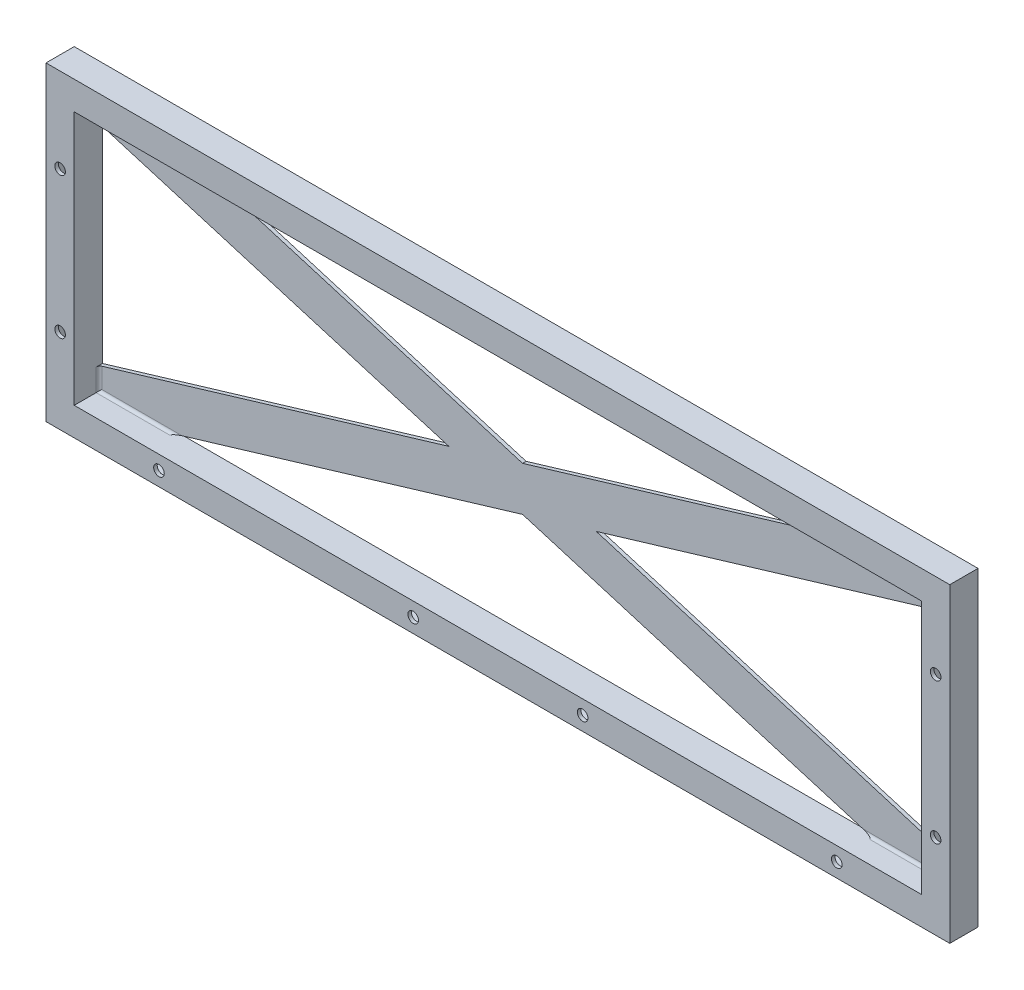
ISO-10303-21;
HEADER;
FILE_DESCRIPTION(('STEP AP214'),'2;1');
FILE_NAME('part.step','',(''),(''),'','','');
FILE_SCHEMA(('AUTOMOTIVE_DESIGN { 1 0 10303 214 1 1 1 1 }'));
ENDSEC;
DATA;
#1=APPLICATION_CONTEXT('core data for automotive mechanical design processes');
#2=APPLICATION_PROTOCOL_DEFINITION('international standard','automotive_design',2000,#1);
#3=PRODUCT_CONTEXT('',#1,'mechanical');
#4=PRODUCT('Part','Part','',(#3));
#5=PRODUCT_RELATED_PRODUCT_CATEGORY('part','',(#4));
#6=PRODUCT_DEFINITION_FORMATION('','',#4);
#7=PRODUCT_DEFINITION_CONTEXT('part definition',#1,'design');
#8=PRODUCT_DEFINITION('design','',#6,#7);
#9=PRODUCT_DEFINITION_SHAPE('','',#8);
#10=(LENGTH_UNIT() NAMED_UNIT(*) SI_UNIT(.MILLI.,.METRE.));
#11=(NAMED_UNIT(*) PLANE_ANGLE_UNIT() SI_UNIT($,.RADIAN.));
#12=(NAMED_UNIT(*) SI_UNIT($,.STERADIAN.) SOLID_ANGLE_UNIT());
#13=UNCERTAINTY_MEASURE_WITH_UNIT(LENGTH_MEASURE(1.E-05),#10,'distance_accuracy_value','');
#14=(GEOMETRIC_REPRESENTATION_CONTEXT(3) GLOBAL_UNCERTAINTY_ASSIGNED_CONTEXT((#13)) GLOBAL_UNIT_ASSIGNED_CONTEXT((#10,
#11,#12)) REPRESENTATION_CONTEXT('',''));
#15=CARTESIAN_POINT('',(0.,0.,0.));
#16=DIRECTION('',(0.,0.,1.));
#17=DIRECTION('',(1.,0.,0.));
#18=AXIS2_PLACEMENT_3D('',#15,#16,#17);
#19=CARTESIAN_POINT('',(0.,0.,3.175));
#20=DIRECTION('',(0.,0.,1.));
#21=DIRECTION('',(1.,0.,0.));
#22=AXIS2_PLACEMENT_3D('',#19,#20,#21);
#23=PLANE('',#22);
#24=DIRECTION('',(1.,0.,0.));
#25=VECTOR('',#24,1.);
#26=CARTESIAN_POINT('',(-381.,111.76,3.175));
#27=LINE('',#26,#25);
#28=CARTESIAN_POINT('',(-306.237387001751,111.76,3.175));
#29=VERTEX_POINT('',#28);
#30=CARTESIAN_POINT('',(-378.46,111.76,3.175));
#31=VERTEX_POINT('',#30);
#32=EDGE_CURVE('E589',#29,#31,#27,.F.);
#33=ORIENTED_EDGE('',*,*,#32,.T.);
#34=DIRECTION('',(0.,-1.,0.));
#35=VECTOR('',#34,1.);
#36=CARTESIAN_POINT('',(-378.46,94.4112161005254,3.175));
#37=LINE('',#36,#35);
#38=CARTESIAN_POINT('',(-378.46,93.6492161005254,3.175));
#39=VERTEX_POINT('',#38);
#40=EDGE_CURVE('E591',#31,#39,#37,.T.);
#41=ORIENTED_EDGE('',*,*,#40,.T.);
#42=DIRECTION('',(0.957826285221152,-0.287347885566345,0.));
#43=VECTOR('',#42,1.);
#44=CARTESIAN_POINT('',(-5.47397722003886,-18.2465907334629,3.175));
#45=LINE('',#44,#43);
#46=CARTESIAN_POINT('',(-66.295946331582,0.,3.175));
#47=VERTEX_POINT('',#46);
#48=EDGE_CURVE('E495',#39,#47,#45,.T.);
#49=ORIENTED_EDGE('',*,*,#48,.T.);
#50=DIRECTION('',(0.957826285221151,0.287347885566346,0.));
#51=VECTOR('',#50,1.);
#52=CARTESIAN_POINT('',(-5.4739772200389,18.246590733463,3.175));
#53=LINE('',#52,#51);
#54=CARTESIAN_POINT('',(-378.46,-93.6492161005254,3.175));
#55=VERTEX_POINT('',#54);
#56=EDGE_CURVE('E498',#55,#47,#53,.T.);
#57=ORIENTED_EDGE('',*,*,#56,.F.);
#58=DIRECTION('',(0.,-1.,0.));
#59=VECTOR('',#58,1.);
#60=CARTESIAN_POINT('',(-378.46,-114.3,3.175));
#61=LINE('',#60,#59);
#62=CARTESIAN_POINT('',(-378.46,-111.76,3.175));
#63=VERTEX_POINT('',#62);
#64=EDGE_CURVE('E574',#55,#63,#61,.T.);
#65=ORIENTED_EDGE('',*,*,#64,.T.);
#66=DIRECTION('',(1.,0.,0.));
#67=VECTOR('',#66,1.);
#68=CARTESIAN_POINT('',(-314.704053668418,-111.76,3.175));
#69=LINE('',#68,#67);
#70=CARTESIAN_POINT('',(-306.237387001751,-111.76,3.175));
#71=VERTEX_POINT('',#70);
#72=EDGE_CURVE('E465',#63,#71,#69,.T.);
#73=ORIENTED_EDGE('',*,*,#72,.T.);
#74=DIRECTION('',(0.957826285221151,0.287347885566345,0.));
#75=VECTOR('',#74,1.);
#76=CARTESIAN_POINT('',(5.47397722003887,-18.2465907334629,3.175));
#77=LINE('',#76,#75);
#78=CARTESIAN_POINT('',(0.,-19.8887838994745,3.175));
#79=VERTEX_POINT('',#78);
#80=EDGE_CURVE('E478',#71,#79,#77,.T.);
#81=ORIENTED_EDGE('',*,*,#80,.T.);
#82=DIRECTION('',(0.957826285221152,-0.287347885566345,0.));
#83=VECTOR('',#82,1.);
#84=CARTESIAN_POINT('',(-5.47397722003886,-18.2465907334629,3.175));
#85=LINE('',#84,#83);
#86=CARTESIAN_POINT('',(306.237387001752,-111.76,3.175));
#87=VERTEX_POINT('',#86);
#88=EDGE_CURVE('E480',#79,#87,#85,.T.);
#89=ORIENTED_EDGE('',*,*,#88,.T.);
#90=DIRECTION('',(-1.,0.,0.));
#91=VECTOR('',#90,1.);
#92=CARTESIAN_POINT('',(381.,-111.76,3.175));
#93=LINE('',#92,#91);
#94=CARTESIAN_POINT('',(378.46,-111.76,3.175));
#95=VERTEX_POINT('',#94);
#96=EDGE_CURVE('E580',#87,#95,#93,.F.);
#97=ORIENTED_EDGE('',*,*,#96,.T.);
#98=DIRECTION('',(0.,-1.,0.));
#99=VECTOR('',#98,1.);
#100=CARTESIAN_POINT('',(378.46,-94.4112161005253,3.175));
#101=LINE('',#100,#99);
#102=CARTESIAN_POINT('',(378.46,-93.6492161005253,3.175));
#103=VERTEX_POINT('',#102);
#104=EDGE_CURVE('E581',#95,#103,#101,.F.);
#105=ORIENTED_EDGE('',*,*,#104,.T.);
#106=DIRECTION('',(0.957826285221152,-0.287347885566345,0.));
#107=VECTOR('',#106,1.);
#108=CARTESIAN_POINT('',(5.47397722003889,18.246590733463,3.175));
#109=LINE('',#108,#107);
#110=CARTESIAN_POINT('',(66.295946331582,0.,3.175));
#111=VERTEX_POINT('',#110);
#112=EDGE_CURVE('E484',#111,#103,#109,.T.);
#113=ORIENTED_EDGE('',*,*,#112,.F.);
#114=DIRECTION('',(0.957826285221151,0.287347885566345,0.));
#115=VECTOR('',#114,1.);
#116=CARTESIAN_POINT('',(5.47397722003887,-18.2465907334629,3.175));
#117=LINE('',#116,#115);
#118=CARTESIAN_POINT('',(378.46,93.6492161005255,3.175));
#119=VERTEX_POINT('',#118);
#120=EDGE_CURVE('E487',#111,#119,#117,.T.);
#121=ORIENTED_EDGE('',*,*,#120,.T.);
#122=DIRECTION('',(0.,-1.,0.));
#123=VECTOR('',#122,1.);
#124=CARTESIAN_POINT('',(378.46,114.3,3.175));
#125=LINE('',#124,#123);
#126=CARTESIAN_POINT('',(378.46,111.76,3.175));
#127=VERTEX_POINT('',#126);
#128=EDGE_CURVE('E587',#119,#127,#125,.F.);
#129=ORIENTED_EDGE('',*,*,#128,.T.);
#130=DIRECTION('',(1.,0.,0.));
#131=VECTOR('',#130,1.);
#132=CARTESIAN_POINT('',(314.704053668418,111.76,3.175));
#133=LINE('',#132,#131);
#134=CARTESIAN_POINT('',(306.237387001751,111.76,3.175));
#135=VERTEX_POINT('',#134);
#136=EDGE_CURVE('E585',#127,#135,#133,.F.);
#137=ORIENTED_EDGE('',*,*,#136,.T.);
#138=DIRECTION('',(0.957826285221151,0.287347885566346,0.));
#139=VECTOR('',#138,1.);
#140=CARTESIAN_POINT('',(-5.4739772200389,18.246590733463,3.175));
#141=LINE('',#140,#139);
#142=CARTESIAN_POINT('',(0.,19.8887838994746,3.175));
#143=VERTEX_POINT('',#142);
#144=EDGE_CURVE('E490',#143,#135,#141,.T.);
#145=ORIENTED_EDGE('',*,*,#144,.F.);
#146=DIRECTION('',(0.957826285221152,-0.287347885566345,0.));
#147=VECTOR('',#146,1.);
#148=CARTESIAN_POINT('',(5.47397722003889,18.246590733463,3.175));
#149=LINE('',#148,#147);
#150=EDGE_CURVE('E493',#29,#143,#149,.T.);
#151=ORIENTED_EDGE('',*,*,#150,.F.);
#152=EDGE_LOOP('',(#33,#41,#49,#57,#65,#73,#81,#89,#97,#105,#113,#121,#129,#137,#145,#151));
#153=FACE_BOUND('',#152,.T.);
#154=ADVANCED_FACE('F39',(#153),#23,.T.);
#155=CARTESIAN_POINT('',(5.47397722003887,-18.2465907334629,3.175));
#156=DIRECTION('',(-0.287347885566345,0.957826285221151,0.));
#157=DIRECTION('',(-0.957826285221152,-0.287347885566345,0.));
#158=AXIS2_PLACEMENT_3D('',#155,#156,#157);
#159=PLANE('',#158);
#160=DIRECTION('',(0.957826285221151,0.287347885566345,0.));
#161=VECTOR('',#160,1.);
#162=CARTESIAN_POINT('',(5.47397722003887,-18.2465907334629,0.));
#163=LINE('',#162,#161);
#164=CARTESIAN_POINT('',(-314.704053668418,-114.3,0.));
#165=VERTEX_POINT('',#164);
#166=CARTESIAN_POINT('',(0.,-19.8887838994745,0.));
#167=VERTEX_POINT('',#166);
#168=EDGE_CURVE('E428',#165,#167,#163,.T.);
#169=ORIENTED_EDGE('',*,*,#168,.T.);
#170=DIRECTION('',(0.,0.,-1.));
#171=VECTOR('',#170,1.);
#172=CARTESIAN_POINT('',(0.,-19.8887838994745,3.175));
#173=LINE('',#172,#171);
#174=EDGE_CURVE('E444',#79,#167,#173,.T.);
#175=ORIENTED_EDGE('',*,*,#174,.F.);
#176=ORIENTED_EDGE('',*,*,#80,.F.);
#177=CARTESIAN_POINT('',(-306.237387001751,-111.76,5.715));
#178=DIRECTION('',(-0.287347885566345,0.957826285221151,0.));
#179=DIRECTION('',(-0.957826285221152,-0.287347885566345,0.));
#180=AXIS2_PLACEMENT_3D('',#177,#178,#179);
#181=ELLIPSE('',#180,8.8394595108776,2.54);
#182=CARTESIAN_POINT('',(-314.704053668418,-114.3,5.715));
#183=VERTEX_POINT('',#182);
#184=EDGE_CURVE('E11',#71,#183,#181,.T.);
#185=ORIENTED_EDGE('',*,*,#184,.T.);
#186=DIRECTION('',(0.,0.,-1.));
#187=VECTOR('',#186,1.);
#188=CARTESIAN_POINT('',(-314.704053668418,-114.3,3.175));
#189=LINE('',#188,#187);
#190=EDGE_CURVE('E64',#183,#165,#189,.T.);
#191=ORIENTED_EDGE('',*,*,#190,.T.);
#192=EDGE_LOOP('',(#169,#175,#176,#185,#191));
#193=FACE_BOUND('',#192,.T.);
#194=ADVANCED_FACE('F752',(#193),#159,.F.);
#195=CARTESIAN_POINT('',(-5.47397722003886,-18.2465907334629,3.175));
#196=DIRECTION('',(0.287347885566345,0.957826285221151,0.));
#197=DIRECTION('',(-0.957826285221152,0.287347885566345,0.));
#198=AXIS2_PLACEMENT_3D('',#195,#196,#197);
#199=PLANE('',#198);
#200=DIRECTION('',(0.957826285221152,-0.287347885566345,0.));
#201=VECTOR('',#200,1.);
#202=CARTESIAN_POINT('',(-5.47397722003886,-18.2465907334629,0.));
#203=LINE('',#202,#201);
#204=CARTESIAN_POINT('',(314.704053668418,-114.3,0.));
#205=VERTEX_POINT('',#204);
#206=EDGE_CURVE('E515',#167,#205,#203,.T.);
#207=ORIENTED_EDGE('',*,*,#206,.T.);
#208=DIRECTION('',(0.,0.,-1.));
#209=VECTOR('',#208,1.);
#210=CARTESIAN_POINT('',(314.704053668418,-114.3,3.175));
#211=LINE('',#210,#209);
#212=CARTESIAN_POINT('',(314.704053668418,-114.3,5.715));
#213=VERTEX_POINT('',#212);
#214=EDGE_CURVE('E56',#213,#205,#211,.T.);
#215=ORIENTED_EDGE('',*,*,#214,.F.);
#216=CARTESIAN_POINT('',(306.237387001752,-111.76,5.715));
#217=DIRECTION('',(0.287347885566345,0.957826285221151,0.));
#218=DIRECTION('',(0.957826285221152,-0.287347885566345,0.));
#219=AXIS2_PLACEMENT_3D('',#216,#217,#218);
#220=ELLIPSE('',#219,8.8394595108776,2.54);
#221=EDGE_CURVE('E570',#213,#87,#220,.T.);
#222=ORIENTED_EDGE('',*,*,#221,.T.);
#223=ORIENTED_EDGE('',*,*,#88,.F.);
#224=ORIENTED_EDGE('',*,*,#174,.T.);
#225=EDGE_LOOP('',(#207,#215,#222,#223,#224));
#226=FACE_BOUND('',#225,.T.);
#227=ADVANCED_FACE('F748',(#226),#199,.F.);
#228=CARTESIAN_POINT('',(5.47397722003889,18.246590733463,3.175));
#229=DIRECTION('',(0.287347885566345,0.957826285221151,0.));
#230=DIRECTION('',(-0.957826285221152,0.287347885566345,0.));
#231=AXIS2_PLACEMENT_3D('',#228,#229,#230);
#232=PLANE('',#231);
#233=DIRECTION('',(0.957826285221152,-0.287347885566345,0.));
#234=VECTOR('',#233,1.);
#235=CARTESIAN_POINT('',(5.47397722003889,18.246590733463,0.));
#236=LINE('',#235,#234);
#237=CARTESIAN_POINT('',(66.295946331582,0.,0.));
#238=VERTEX_POINT('',#237);
#239=CARTESIAN_POINT('',(381.,-94.4112161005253,0.));
#240=VERTEX_POINT('',#239);
#241=EDGE_CURVE('E519',#238,#240,#236,.T.);
#242=ORIENTED_EDGE('',*,*,#241,.F.);
#243=DIRECTION('',(0.,0.,-1.));
#244=VECTOR('',#243,1.);
#245=CARTESIAN_POINT('',(66.295946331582,0.,3.175));
#246=LINE('',#245,#244);
#247=EDGE_CURVE('E454',#111,#238,#246,.T.);
#248=ORIENTED_EDGE('',*,*,#247,.F.);
#249=ORIENTED_EDGE('',*,*,#112,.T.);
#250=CARTESIAN_POINT('',(378.46,-93.6492161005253,5.715));
#251=DIRECTION('',(0.287347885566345,0.957826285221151,0.));
#252=DIRECTION('',(-0.957826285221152,0.287347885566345,0.));
#253=AXIS2_PLACEMENT_3D('',#250,#251,#252);
#254=ELLIPSE('',#253,2.65183785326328,2.54);
#255=CARTESIAN_POINT('',(381.,-94.4112161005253,5.715));
#256=VERTEX_POINT('',#255);
#257=EDGE_CURVE('E620',#103,#256,#254,.F.);
#258=ORIENTED_EDGE('',*,*,#257,.T.);
#259=DIRECTION('',(0.,0.,-1.));
#260=VECTOR('',#259,1.);
#261=CARTESIAN_POINT('',(381.,-94.4112161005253,3.175));
#262=LINE('',#261,#260);
#263=EDGE_CURVE('E443',#256,#240,#262,.T.);
#264=ORIENTED_EDGE('',*,*,#263,.T.);
#265=EDGE_LOOP('',(#242,#248,#249,#258,#264));
#266=FACE_BOUND('',#265,.T.);
#267=ADVANCED_FACE('F745',(#266),#232,.T.);
#268=CARTESIAN_POINT('',(5.47397722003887,-18.2465907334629,3.175));
#269=DIRECTION('',(-0.287347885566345,0.957826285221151,0.));
#270=DIRECTION('',(-0.957826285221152,-0.287347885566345,0.));
#271=AXIS2_PLACEMENT_3D('',#268,#269,#270);
#272=PLANE('',#271);
#273=DIRECTION('',(0.957826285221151,0.287347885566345,0.));
#274=VECTOR('',#273,1.);
#275=CARTESIAN_POINT('',(5.47397722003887,-18.2465907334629,0.));
#276=LINE('',#275,#274);
#277=CARTESIAN_POINT('',(381.,94.4112161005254,0.));
#278=VERTEX_POINT('',#277);
#279=EDGE_CURVE('E523',#238,#278,#276,.T.);
#280=ORIENTED_EDGE('',*,*,#279,.T.);
#281=DIRECTION('',(0.,0.,-1.));
#282=VECTOR('',#281,1.);
#283=CARTESIAN_POINT('',(381.,94.4112161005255,3.175));
#284=LINE('',#283,#282);
#285=CARTESIAN_POINT('',(381.,94.4112161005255,5.715));
#286=VERTEX_POINT('',#285);
#287=EDGE_CURVE('E456',#286,#278,#284,.T.);
#288=ORIENTED_EDGE('',*,*,#287,.F.);
#289=CARTESIAN_POINT('',(378.46,93.6492161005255,5.715));
#290=DIRECTION('',(-0.287347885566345,0.957826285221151,0.));
#291=DIRECTION('',(0.957826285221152,0.287347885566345,0.));
#292=AXIS2_PLACEMENT_3D('',#289,#290,#291);
#293=ELLIPSE('',#292,2.65183785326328,2.54);
#294=EDGE_CURVE('E615',#286,#119,#293,.T.);
#295=ORIENTED_EDGE('',*,*,#294,.T.);
#296=ORIENTED_EDGE('',*,*,#120,.F.);
#297=ORIENTED_EDGE('',*,*,#247,.T.);
#298=EDGE_LOOP('',(#280,#288,#295,#296,#297));
#299=FACE_BOUND('',#298,.T.);
#300=ADVANCED_FACE('F741',(#299),#272,.F.);
#301=CARTESIAN_POINT('',(-5.4739772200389,18.246590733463,3.175));
#302=DIRECTION('',(-0.287347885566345,0.957826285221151,0.));
#303=DIRECTION('',(-0.957826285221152,-0.287347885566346,0.));
#304=AXIS2_PLACEMENT_3D('',#301,#302,#303);
#305=PLANE('',#304);
#306=DIRECTION('',(0.957826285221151,0.287347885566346,0.));
#307=VECTOR('',#306,1.);
#308=CARTESIAN_POINT('',(-5.4739772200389,18.246590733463,0.));
#309=LINE('',#308,#307);
#310=CARTESIAN_POINT('',(0.,19.8887838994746,0.));
#311=VERTEX_POINT('',#310);
#312=CARTESIAN_POINT('',(314.704053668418,114.3,0.));
#313=VERTEX_POINT('',#312);
#314=EDGE_CURVE('E527',#311,#313,#309,.T.);
#315=ORIENTED_EDGE('',*,*,#314,.F.);
#316=DIRECTION('',(0.,0.,-1.));
#317=VECTOR('',#316,1.);
#318=CARTESIAN_POINT('',(0.,19.8887838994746,3.175));
#319=LINE('',#318,#317);
#320=EDGE_CURVE('E450',#143,#311,#319,.T.);
#321=ORIENTED_EDGE('',*,*,#320,.F.);
#322=ORIENTED_EDGE('',*,*,#144,.T.);
#323=CARTESIAN_POINT('',(306.237387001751,111.76,5.715));
#324=DIRECTION('',(-0.287347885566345,0.957826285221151,0.));
#325=DIRECTION('',(-0.957826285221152,-0.287347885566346,0.));
#326=AXIS2_PLACEMENT_3D('',#323,#324,#325);
#327=ELLIPSE('',#326,8.8394595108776,2.54);
#328=CARTESIAN_POINT('',(314.704053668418,114.3,5.715));
#329=VERTEX_POINT('',#328);
#330=EDGE_CURVE('E617',#135,#329,#327,.F.);
#331=ORIENTED_EDGE('',*,*,#330,.T.);
#332=DIRECTION('',(0.,0.,-1.));
#333=VECTOR('',#332,1.);
#334=CARTESIAN_POINT('',(314.704053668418,114.3,3.175));
#335=LINE('',#334,#333);
#336=EDGE_CURVE('E439',#329,#313,#335,.T.);
#337=ORIENTED_EDGE('',*,*,#336,.T.);
#338=EDGE_LOOP('',(#315,#321,#322,#331,#337));
#339=FACE_BOUND('',#338,.T.);
#340=ADVANCED_FACE('F738',(#339),#305,.T.);
#341=CARTESIAN_POINT('',(5.47397722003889,18.246590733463,3.175));
#342=DIRECTION('',(0.287347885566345,0.957826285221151,0.));
#343=DIRECTION('',(-0.957826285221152,0.287347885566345,0.));
#344=AXIS2_PLACEMENT_3D('',#341,#342,#343);
#345=PLANE('',#344);
#346=DIRECTION('',(0.957826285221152,-0.287347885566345,0.));
#347=VECTOR('',#346,1.);
#348=CARTESIAN_POINT('',(5.47397722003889,18.246590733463,0.));
#349=LINE('',#348,#347);
#350=CARTESIAN_POINT('',(-314.704053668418,114.3,0.));
#351=VERTEX_POINT('',#350);
#352=EDGE_CURVE('E507',#351,#311,#349,.T.);
#353=ORIENTED_EDGE('',*,*,#352,.F.);
#354=DIRECTION('',(0.,0.,-1.));
#355=VECTOR('',#354,1.);
#356=CARTESIAN_POINT('',(-314.704053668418,114.3,3.175));
#357=LINE('',#356,#355);
#358=CARTESIAN_POINT('',(-314.704053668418,114.3,5.715));
#359=VERTEX_POINT('',#358);
#360=EDGE_CURVE('E460',#359,#351,#357,.T.);
#361=ORIENTED_EDGE('',*,*,#360,.F.);
#362=CARTESIAN_POINT('',(-306.237387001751,111.76,5.715));
#363=DIRECTION('',(0.287347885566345,0.957826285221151,0.));
#364=DIRECTION('',(-0.957826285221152,0.287347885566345,0.));
#365=AXIS2_PLACEMENT_3D('',#362,#363,#364);
#366=ELLIPSE('',#365,8.8394595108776,2.54);
#367=EDGE_CURVE('E613',#359,#29,#366,.F.);
#368=ORIENTED_EDGE('',*,*,#367,.T.);
#369=ORIENTED_EDGE('',*,*,#150,.T.);
#370=ORIENTED_EDGE('',*,*,#320,.T.);
#371=EDGE_LOOP('',(#353,#361,#368,#369,#370));
#372=FACE_BOUND('',#371,.T.);
#373=ADVANCED_FACE('F735',(#372),#345,.T.);
#374=CARTESIAN_POINT('',(-5.47397722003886,-18.2465907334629,3.175));
#375=DIRECTION('',(0.287347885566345,0.957826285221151,0.));
#376=DIRECTION('',(-0.957826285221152,0.287347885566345,0.));
#377=AXIS2_PLACEMENT_3D('',#374,#375,#376);
#378=PLANE('',#377);
#379=DIRECTION('',(0.957826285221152,-0.287347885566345,0.));
#380=VECTOR('',#379,1.);
#381=CARTESIAN_POINT('',(-5.47397722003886,-18.2465907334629,0.));
#382=LINE('',#381,#380);
#383=CARTESIAN_POINT('',(-381.,94.4112161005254,0.));
#384=VERTEX_POINT('',#383);
#385=CARTESIAN_POINT('',(-66.295946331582,0.,0.));
#386=VERTEX_POINT('',#385);
#387=EDGE_CURVE('E504',#384,#386,#382,.T.);
#388=ORIENTED_EDGE('',*,*,#387,.T.);
#389=DIRECTION('',(0.,0.,-1.));
#390=VECTOR('',#389,1.);
#391=CARTESIAN_POINT('',(-66.295946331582,0.,3.175));
#392=LINE('',#391,#390);
#393=EDGE_CURVE('E471',#47,#386,#392,.T.);
#394=ORIENTED_EDGE('',*,*,#393,.F.);
#395=ORIENTED_EDGE('',*,*,#48,.F.);
#396=CARTESIAN_POINT('',(-378.46,93.6492161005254,5.715));
#397=DIRECTION('',(0.287347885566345,0.957826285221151,0.));
#398=DIRECTION('',(-0.957826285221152,0.287347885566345,0.));
#399=AXIS2_PLACEMENT_3D('',#396,#397,#398);
#400=ELLIPSE('',#399,2.65183785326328,2.54);
#401=CARTESIAN_POINT('',(-381.,94.4112161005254,5.715));
#402=VERTEX_POINT('',#401);
#403=EDGE_CURVE('E611',#39,#402,#400,.T.);
#404=ORIENTED_EDGE('',*,*,#403,.T.);
#405=DIRECTION('',(0.,0.,-1.));
#406=VECTOR('',#405,1.);
#407=CARTESIAN_POINT('',(-381.,94.4112161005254,3.175));
#408=LINE('',#407,#406);
#409=EDGE_CURVE('E474',#402,#384,#408,.T.);
#410=ORIENTED_EDGE('',*,*,#409,.T.);
#411=EDGE_LOOP('',(#388,#394,#395,#404,#410));
#412=FACE_BOUND('',#411,.T.);
#413=ADVANCED_FACE('F555',(#412),#378,.F.);
#414=CARTESIAN_POINT('',(-5.4739772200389,18.246590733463,3.175));
#415=DIRECTION('',(-0.287347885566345,0.957826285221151,0.));
#416=DIRECTION('',(-0.957826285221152,-0.287347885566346,0.));
#417=AXIS2_PLACEMENT_3D('',#414,#415,#416);
#418=PLANE('',#417);
#419=DIRECTION('',(0.957826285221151,0.287347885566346,0.));
#420=VECTOR('',#419,1.);
#421=CARTESIAN_POINT('',(-5.4739772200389,18.246590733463,0.));
#422=LINE('',#421,#420);
#423=CARTESIAN_POINT('',(-381.,-94.4112161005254,0.));
#424=VERTEX_POINT('',#423);
#425=EDGE_CURVE('E481',#424,#386,#422,.T.);
#426=ORIENTED_EDGE('',*,*,#425,.F.);
#427=DIRECTION('',(0.,0.,-1.));
#428=VECTOR('',#427,1.);
#429=CARTESIAN_POINT('',(-381.,-94.4112161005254,3.175));
#430=LINE('',#429,#428);
#431=CARTESIAN_POINT('',(-381.,-94.4112161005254,5.715));
#432=VERTEX_POINT('',#431);
#433=EDGE_CURVE('E476',#432,#424,#430,.T.);
#434=ORIENTED_EDGE('',*,*,#433,.F.);
#435=CARTESIAN_POINT('',(-378.46,-93.6492161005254,5.715));
#436=DIRECTION('',(-0.287347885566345,0.957826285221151,0.));
#437=DIRECTION('',(0.957826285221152,0.287347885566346,0.));
#438=AXIS2_PLACEMENT_3D('',#435,#436,#437);
#439=ELLIPSE('',#438,2.65183785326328,2.54);
#440=EDGE_CURVE('E48',#432,#55,#439,.F.);
#441=ORIENTED_EDGE('',*,*,#440,.T.);
#442=ORIENTED_EDGE('',*,*,#56,.T.);
#443=ORIENTED_EDGE('',*,*,#393,.T.);
#444=EDGE_LOOP('',(#426,#434,#441,#442,#443));
#445=FACE_BOUND('',#444,.T.);
#446=ADVANCED_FACE('F550',(#445),#418,.T.);
#447=CARTESIAN_POINT('',(0.,0.,0.));
#448=DIRECTION('',(0.,0.,1.));
#449=DIRECTION('',(1.,0.,0.));
#450=AXIS2_PLACEMENT_3D('',#447,#448,#449);
#451=PLANE('',#450);
#452=CARTESIAN_POINT('',(304.8,-127.,0.));
#453=DIRECTION('',(0.,0.,1.));
#454=DIRECTION('',(1.,0.,0.));
#455=AXIS2_PLACEMENT_3D('',#452,#453,#454);
#456=CIRCLE('',#455,4.7625);
#457=CARTESIAN_POINT('',(309.5625,-127.,0.));
#458=VERTEX_POINT('',#457);
#459=EDGE_CURVE('E928',#458,#458,#456,.T.);
#460=ORIENTED_EDGE('',*,*,#459,.T.);
#461=EDGE_LOOP('',(#460));
#462=FACE_BOUND('',#461,.T.);
#463=CARTESIAN_POINT('',(76.2,-127.,0.));
#464=DIRECTION('',(0.,0.,1.));
#465=DIRECTION('',(1.,0.,0.));
#466=AXIS2_PLACEMENT_3D('',#463,#464,#465);
#467=CIRCLE('',#466,4.76249999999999);
#468=CARTESIAN_POINT('',(80.9625,-127.,0.));
#469=VERTEX_POINT('',#468);
#470=EDGE_CURVE('E43',#469,#469,#467,.T.);
#471=ORIENTED_EDGE('',*,*,#470,.T.);
#472=EDGE_LOOP('',(#471));
#473=FACE_BOUND('',#472,.T.);
#474=CARTESIAN_POINT('',(-304.8,-127.,0.));
#475=DIRECTION('',(0.,0.,1.));
#476=DIRECTION('',(1.,0.,0.));
#477=AXIS2_PLACEMENT_3D('',#474,#475,#476);
#478=CIRCLE('',#477,4.7625);
#479=CARTESIAN_POINT('',(-300.0375,-127.,0.));
#480=VERTEX_POINT('',#479);
#481=EDGE_CURVE('E941',#480,#480,#478,.T.);
#482=ORIENTED_EDGE('',*,*,#481,.T.);
#483=EDGE_LOOP('',(#482));
#484=FACE_BOUND('',#483,.T.);
#485=CARTESIAN_POINT('',(-76.2,-127.,0.));
#486=DIRECTION('',(0.,0.,1.));
#487=DIRECTION('',(1.,0.,0.));
#488=AXIS2_PLACEMENT_3D('',#485,#486,#487);
#489=CIRCLE('',#488,4.76249999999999);
#490=CARTESIAN_POINT('',(-71.4375,-127.,0.));
#491=VERTEX_POINT('',#490);
#492=EDGE_CURVE('E632',#491,#491,#489,.T.);
#493=ORIENTED_EDGE('',*,*,#492,.T.);
#494=EDGE_LOOP('',(#493));
#495=FACE_BOUND('',#494,.T.);
#496=ORIENTED_EDGE('',*,*,#314,.T.);
#497=DIRECTION('',(-1.,0.,0.));
#498=VECTOR('',#497,1.);
#499=CARTESIAN_POINT('',(381.,114.3,0.));
#500=LINE('',#499,#498);
#501=EDGE_CURVE('E380',#313,#351,#500,.T.);
#502=ORIENTED_EDGE('',*,*,#501,.T.);
#503=ORIENTED_EDGE('',*,*,#352,.T.);
#504=EDGE_LOOP('',(#496,#502,#503));
#505=FACE_BOUND('',#504,.T.);
#506=ORIENTED_EDGE('',*,*,#241,.T.);
#507=DIRECTION('',(0.,1.,0.));
#508=VECTOR('',#507,1.);
#509=CARTESIAN_POINT('',(381.,-114.3,0.));
#510=LINE('',#509,#508);
#511=EDGE_CURVE('E663',#240,#278,#510,.T.);
#512=ORIENTED_EDGE('',*,*,#511,.T.);
#513=ORIENTED_EDGE('',*,*,#279,.F.);
#514=EDGE_LOOP('',(#506,#512,#513));
#515=FACE_BOUND('',#514,.T.);
#516=ORIENTED_EDGE('',*,*,#168,.F.);
#517=DIRECTION('',(1.,0.,0.));
#518=VECTOR('',#517,1.);
#519=CARTESIAN_POINT('',(381.,-114.3,0.));
#520=LINE('',#519,#518);
#521=EDGE_CURVE('E437',#165,#205,#520,.T.);
#522=ORIENTED_EDGE('',*,*,#521,.T.);
#523=ORIENTED_EDGE('',*,*,#206,.F.);
#524=EDGE_LOOP('',(#516,#522,#523));
#525=FACE_BOUND('',#524,.T.);
#526=ORIENTED_EDGE('',*,*,#387,.F.);
#527=DIRECTION('',(0.,-1.,0.));
#528=VECTOR('',#527,1.);
#529=CARTESIAN_POINT('',(-381.,-114.3,0.));
#530=LINE('',#529,#528);
#531=EDGE_CURVE('E385',#384,#424,#530,.T.);
#532=ORIENTED_EDGE('',*,*,#531,.T.);
#533=ORIENTED_EDGE('',*,*,#425,.T.);
#534=EDGE_LOOP('',(#526,#532,#533));
#535=FACE_BOUND('',#534,.T.);
#536=CARTESIAN_POINT('',(393.7,-63.5,0.));
#537=DIRECTION('',(0.,0.,1.));
#538=DIRECTION('',(1.,0.,0.));
#539=AXIS2_PLACEMENT_3D('',#536,#537,#538);
#540=CIRCLE('',#539,4.7625);
#541=CARTESIAN_POINT('',(398.4625,-63.5,0.));
#542=VERTEX_POINT('',#541);
#543=EDGE_CURVE('E422',#542,#542,#540,.T.);
#544=ORIENTED_EDGE('',*,*,#543,.T.);
#545=EDGE_LOOP('',(#544));
#546=FACE_BOUND('',#545,.T.);
#547=CARTESIAN_POINT('',(393.7,63.5000000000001,0.));
#548=DIRECTION('',(0.,0.,1.));
#549=DIRECTION('',(1.,0.,0.));
#550=AXIS2_PLACEMENT_3D('',#547,#548,#549);
#551=CIRCLE('',#550,4.7625);
#552=CARTESIAN_POINT('',(398.4625,63.5000000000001,0.));
#553=VERTEX_POINT('',#552);
#554=EDGE_CURVE('E410',#553,#553,#551,.T.);
#555=ORIENTED_EDGE('',*,*,#554,.T.);
#556=EDGE_LOOP('',(#555));
#557=FACE_BOUND('',#556,.T.);
#558=CARTESIAN_POINT('',(-393.7,-63.5,0.));
#559=DIRECTION('',(0.,0.,1.));
#560=DIRECTION('',(1.,0.,0.));
#561=AXIS2_PLACEMENT_3D('',#558,#559,#560);
#562=CIRCLE('',#561,4.7625);
#563=CARTESIAN_POINT('',(-388.9375,-63.5,0.));
#564=VERTEX_POINT('',#563);
#565=EDGE_CURVE('E398',#564,#564,#562,.T.);
#566=ORIENTED_EDGE('',*,*,#565,.T.);
#567=EDGE_LOOP('',(#566));
#568=FACE_BOUND('',#567,.T.);
#569=CARTESIAN_POINT('',(-393.7,63.5000000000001,0.));
#570=DIRECTION('',(0.,0.,1.));
#571=DIRECTION('',(1.,0.,0.));
#572=AXIS2_PLACEMENT_3D('',#569,#570,#571);
#573=CIRCLE('',#572,4.7625);
#574=CARTESIAN_POINT('',(-388.9375,63.5000000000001,0.));
#575=VERTEX_POINT('',#574);
#576=EDGE_CURVE('E386',#575,#575,#573,.T.);
#577=ORIENTED_EDGE('',*,*,#576,.T.);
#578=EDGE_LOOP('',(#577));
#579=FACE_BOUND('',#578,.T.);
#580=DIRECTION('',(0.,-1.,0.));
#581=VECTOR('',#580,1.);
#582=CARTESIAN_POINT('',(-406.4,-139.7,0.));
#583=LINE('',#582,#581);
#584=CARTESIAN_POINT('',(-406.4,139.7,0.));
#585=VERTEX_POINT('',#584);
#586=CARTESIAN_POINT('',(-406.4,-139.7,0.));
#587=VERTEX_POINT('',#586);
#588=EDGE_CURVE('E356',#585,#587,#583,.T.);
#589=ORIENTED_EDGE('',*,*,#588,.F.);
#590=DIRECTION('',(-1.,0.,0.));
#591=VECTOR('',#590,1.);
#592=CARTESIAN_POINT('',(406.4,139.7,0.));
#593=LINE('',#592,#591);
#594=CARTESIAN_POINT('',(406.4,139.7,0.));
#595=VERTEX_POINT('',#594);
#596=EDGE_CURVE('E349',#595,#585,#593,.T.);
#597=ORIENTED_EDGE('',*,*,#596,.F.);
#598=DIRECTION('',(0.,1.,0.));
#599=VECTOR('',#598,1.);
#600=CARTESIAN_POINT('',(406.4,-139.7,0.));
#601=LINE('',#600,#599);
#602=CARTESIAN_POINT('',(406.4,-139.7,0.));
#603=VERTEX_POINT('',#602);
#604=EDGE_CURVE('E351',#603,#595,#601,.T.);
#605=ORIENTED_EDGE('',*,*,#604,.F.);
#606=DIRECTION('',(1.,0.,0.));
#607=VECTOR('',#606,1.);
#608=CARTESIAN_POINT('',(406.4,-139.7,0.));
#609=LINE('',#608,#607);
#610=EDGE_CURVE('E354',#587,#603,#609,.T.);
#611=ORIENTED_EDGE('',*,*,#610,.F.);
#612=EDGE_LOOP('',(#589,#597,#605,#611));
#613=FACE_BOUND('',#612,.T.);
#614=ADVANCED_FACE('F559',(#462,#473,#484,#495,#505,#515,#525,#535,#546,#557,#568,#579,#613),
#451,.F.);
#615=CARTESIAN_POINT('',(-381.,-114.3,25.4));
#616=DIRECTION('',(1.,0.,0.));
#617=DIRECTION('',(0.,0.,-1.));
#618=AXIS2_PLACEMENT_3D('',#615,#616,#617);
#619=PLANE('',#618);
#620=ORIENTED_EDGE('',*,*,#409,.F.);
#621=DIRECTION('',(0.,-1.,0.));
#622=VECTOR('',#621,1.);
#623=CARTESIAN_POINT('',(-381.,114.3,5.715));
#624=LINE('',#623,#622);
#625=CARTESIAN_POINT('',(-381.,114.3,5.715));
#626=VERTEX_POINT('',#625);
#627=EDGE_CURVE('E594',#402,#626,#624,.F.);
#628=ORIENTED_EDGE('',*,*,#627,.T.);
#629=DIRECTION('',(0.,0.,-1.));
#630=VECTOR('',#629,1.);
#631=CARTESIAN_POINT('',(-381.,114.3,25.4));
#632=LINE('',#631,#630);
#633=CARTESIAN_POINT('',(-381.,114.3,25.4));
#634=VERTEX_POINT('',#633);
#635=EDGE_CURVE('E371',#634,#626,#632,.T.);
#636=ORIENTED_EDGE('',*,*,#635,.F.);
#637=DIRECTION('',(0.,-1.,0.));
#638=VECTOR('',#637,1.);
#639=CARTESIAN_POINT('',(-381.,-114.3,25.4));
#640=LINE('',#639,#638);
#641=CARTESIAN_POINT('',(-381.,-114.3,25.4));
#642=VERTEX_POINT('',#641);
#643=EDGE_CURVE('E377',#634,#642,#640,.T.);
#644=ORIENTED_EDGE('',*,*,#643,.T.);
#645=DIRECTION('',(0.,0.,-1.));
#646=VECTOR('',#645,1.);
#647=CARTESIAN_POINT('',(-381.,-114.3,25.4));
#648=LINE('',#647,#646);
#649=CARTESIAN_POINT('',(-381.,-114.3,5.715));
#650=VERTEX_POINT('',#649);
#651=EDGE_CURVE('E359',#642,#650,#648,.T.);
#652=ORIENTED_EDGE('',*,*,#651,.T.);
#653=DIRECTION('',(0.,-1.,0.));
#654=VECTOR('',#653,1.);
#655=CARTESIAN_POINT('',(-381.,-94.4112161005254,5.715));
#656=LINE('',#655,#654);
#657=EDGE_CURVE('E566',#650,#432,#656,.F.);
#658=ORIENTED_EDGE('',*,*,#657,.T.);
#659=ORIENTED_EDGE('',*,*,#433,.T.);
#660=ORIENTED_EDGE('',*,*,#531,.F.);
#661=EDGE_LOOP('',(#620,#628,#636,#644,#652,#658,#659,#660));
#662=FACE_BOUND('',#661,.T.);
#663=ADVANCED_FACE('F562',(#662),#619,.T.);
#664=CARTESIAN_POINT('',(381.,-114.3,25.4));
#665=DIRECTION('',(0.,1.,0.));
#666=DIRECTION('',(-1.,0.,0.));
#667=AXIS2_PLACEMENT_3D('',#664,#665,#666);
#668=PLANE('',#667);
#669=DIRECTION('',(0.,0.,-1.));
#670=VECTOR('',#669,1.);
#671=CARTESIAN_POINT('',(381.,-114.3,25.4));
#672=LINE('',#671,#670);
#673=CARTESIAN_POINT('',(381.,-114.3,25.4));
#674=VERTEX_POINT('',#673);
#675=CARTESIAN_POINT('',(381.,-114.3,5.715));
#676=VERTEX_POINT('',#675);
#677=EDGE_CURVE('E654',#674,#676,#672,.T.);
#678=ORIENTED_EDGE('',*,*,#677,.T.);
#679=DIRECTION('',(-1.,0.,0.));
#680=VECTOR('',#679,1.);
#681=CARTESIAN_POINT('',(314.704053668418,-114.3,5.715));
#682=LINE('',#681,#680);
#683=EDGE_CURVE('E609',#676,#213,#682,.T.);
#684=ORIENTED_EDGE('',*,*,#683,.T.);
#685=ORIENTED_EDGE('',*,*,#214,.T.);
#686=ORIENTED_EDGE('',*,*,#521,.F.);
#687=ORIENTED_EDGE('',*,*,#190,.F.);
#688=DIRECTION('',(1.,0.,0.));
#689=VECTOR('',#688,1.);
#690=CARTESIAN_POINT('',(-381.,-114.3,5.715));
#691=LINE('',#690,#689);
#692=EDGE_CURVE('E607',#183,#650,#691,.F.);
#693=ORIENTED_EDGE('',*,*,#692,.T.);
#694=ORIENTED_EDGE('',*,*,#651,.F.);
#695=DIRECTION('',(1.,0.,0.));
#696=VECTOR('',#695,1.);
#697=CARTESIAN_POINT('',(381.,-114.3,25.4));
#698=LINE('',#697,#696);
#699=EDGE_CURVE('E374',#642,#674,#698,.T.);
#700=ORIENTED_EDGE('',*,*,#699,.T.);
#701=EDGE_LOOP('',(#678,#684,#685,#686,#687,#693,#694,#700));
#702=FACE_BOUND('',#701,.T.);
#703=ADVANCED_FACE('F725',(#702),#668,.T.);
#704=CARTESIAN_POINT('',(381.,-114.3,25.4));
#705=DIRECTION('',(-1.,0.,0.));
#706=DIRECTION('',(0.,0.,1.));
#707=AXIS2_PLACEMENT_3D('',#704,#705,#706);
#708=PLANE('',#707);
#709=DIRECTION('',(0.,0.,-1.));
#710=VECTOR('',#709,1.);
#711=CARTESIAN_POINT('',(381.,114.3,25.4));
#712=LINE('',#711,#710);
#713=CARTESIAN_POINT('',(381.,114.3,25.4));
#714=VERTEX_POINT('',#713);
#715=CARTESIAN_POINT('',(381.,114.3,5.715));
#716=VERTEX_POINT('',#715);
#717=EDGE_CURVE('E671',#714,#716,#712,.T.);
#718=ORIENTED_EDGE('',*,*,#717,.T.);
#719=DIRECTION('',(0.,-1.,0.));
#720=VECTOR('',#719,1.);
#721=CARTESIAN_POINT('',(381.,94.4112161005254,5.715));
#722=LINE('',#721,#720);
#723=EDGE_CURVE('E604',#716,#286,#722,.T.);
#724=ORIENTED_EDGE('',*,*,#723,.T.);
#725=ORIENTED_EDGE('',*,*,#287,.T.);
#726=ORIENTED_EDGE('',*,*,#511,.F.);
#727=ORIENTED_EDGE('',*,*,#263,.F.);
#728=DIRECTION('',(0.,-1.,0.));
#729=VECTOR('',#728,1.);
#730=CARTESIAN_POINT('',(381.,-114.3,5.715));
#731=LINE('',#730,#729);
#732=EDGE_CURVE('E601',#256,#676,#731,.T.);
#733=ORIENTED_EDGE('',*,*,#732,.T.);
#734=ORIENTED_EDGE('',*,*,#677,.F.);
#735=DIRECTION('',(0.,1.,0.));
#736=VECTOR('',#735,1.);
#737=CARTESIAN_POINT('',(381.,-114.3,25.4));
#738=LINE('',#737,#736);
#739=EDGE_CURVE('E370',#674,#714,#738,.T.);
#740=ORIENTED_EDGE('',*,*,#739,.T.);
#741=EDGE_LOOP('',(#718,#724,#725,#726,#727,#733,#734,#740));
#742=FACE_BOUND('',#741,.T.);
#743=ADVANCED_FACE('F830',(#742),#708,.T.);
#744=CARTESIAN_POINT('',(381.,114.3,25.4));
#745=DIRECTION('',(0.,-1.,0.));
#746=DIRECTION('',(1.,0.,0.));
#747=AXIS2_PLACEMENT_3D('',#744,#745,#746);
#748=PLANE('',#747);
#749=ORIENTED_EDGE('',*,*,#635,.T.);
#750=DIRECTION('',(1.,0.,0.));
#751=VECTOR('',#750,1.);
#752=CARTESIAN_POINT('',(-314.704053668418,114.3,5.715));
#753=LINE('',#752,#751);
#754=EDGE_CURVE('E598',#626,#359,#753,.T.);
#755=ORIENTED_EDGE('',*,*,#754,.T.);
#756=ORIENTED_EDGE('',*,*,#360,.T.);
#757=ORIENTED_EDGE('',*,*,#501,.F.);
#758=ORIENTED_EDGE('',*,*,#336,.F.);
#759=DIRECTION('',(1.,0.,0.));
#760=VECTOR('',#759,1.);
#761=CARTESIAN_POINT('',(381.,114.3,5.715));
#762=LINE('',#761,#760);
#763=EDGE_CURVE('E596',#329,#716,#762,.T.);
#764=ORIENTED_EDGE('',*,*,#763,.T.);
#765=ORIENTED_EDGE('',*,*,#717,.F.);
#766=DIRECTION('',(-1.,0.,0.));
#767=VECTOR('',#766,1.);
#768=CARTESIAN_POINT('',(381.,114.3,25.4));
#769=LINE('',#768,#767);
#770=EDGE_CURVE('E367',#714,#634,#769,.T.);
#771=ORIENTED_EDGE('',*,*,#770,.T.);
#772=EDGE_LOOP('',(#749,#755,#756,#757,#758,#764,#765,#771));
#773=FACE_BOUND('',#772,.T.);
#774=ADVANCED_FACE('F714',(#773),#748,.T.);
#775=CARTESIAN_POINT('',(0.,0.,22.225));
#776=DIRECTION('',(0.,0.,1.));
#777=DIRECTION('',(1.,0.,0.));
#778=AXIS2_PLACEMENT_3D('',#775,#776,#777);
#779=PLANE('',#778);
#780=CARTESIAN_POINT('',(304.8,-127.,22.225));
#781=DIRECTION('',(0.,0.,1.));
#782=DIRECTION('',(1.,0.,0.));
#783=AXIS2_PLACEMENT_3D('',#780,#781,#782);
#784=CIRCLE('',#783,4.7625);
#785=CARTESIAN_POINT('',(309.5625,-127.,22.225));
#786=VERTEX_POINT('',#785);
#787=EDGE_CURVE('E921',#786,#786,#784,.T.);
#788=ORIENTED_EDGE('',*,*,#787,.T.);
#789=EDGE_LOOP('',(#788));
#790=FACE_BOUND('',#789,.T.);
#791=CARTESIAN_POINT('',(76.2,-127.,22.225));
#792=DIRECTION('',(0.,0.,1.));
#793=DIRECTION('',(1.,0.,0.));
#794=AXIS2_PLACEMENT_3D('',#791,#792,#793);
#795=CIRCLE('',#794,4.76249999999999);
#796=CARTESIAN_POINT('',(80.9625,-127.,22.225));
#797=VERTEX_POINT('',#796);
#798=EDGE_CURVE('E935',#797,#797,#795,.T.);
#799=ORIENTED_EDGE('',*,*,#798,.T.);
#800=EDGE_LOOP('',(#799));
#801=FACE_BOUND('',#800,.T.);
#802=CARTESIAN_POINT('',(-304.8,-127.,22.225));
#803=DIRECTION('',(0.,0.,1.));
#804=DIRECTION('',(1.,0.,0.));
#805=AXIS2_PLACEMENT_3D('',#802,#803,#804);
#806=CIRCLE('',#805,4.7625);
#807=CARTESIAN_POINT('',(-300.0375,-127.,22.225));
#808=VERTEX_POINT('',#807);
#809=EDGE_CURVE('E641',#808,#808,#806,.T.);
#810=ORIENTED_EDGE('',*,*,#809,.T.);
#811=EDGE_LOOP('',(#810));
#812=FACE_BOUND('',#811,.T.);
#813=CARTESIAN_POINT('',(-76.2,-127.,22.225));
#814=DIRECTION('',(0.,0.,1.));
#815=DIRECTION('',(1.,0.,0.));
#816=AXIS2_PLACEMENT_3D('',#813,#814,#815);
#817=CIRCLE('',#816,4.76249999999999);
#818=CARTESIAN_POINT('',(-71.4375,-127.,22.225));
#819=VERTEX_POINT('',#818);
#820=EDGE_CURVE('E631',#819,#819,#817,.T.);
#821=ORIENTED_EDGE('',*,*,#820,.T.);
#822=EDGE_LOOP('',(#821));
#823=FACE_BOUND('',#822,.T.);
#824=CARTESIAN_POINT('',(393.7,-63.5,22.225));
#825=DIRECTION('',(0.,0.,1.));
#826=DIRECTION('',(1.,0.,0.));
#827=AXIS2_PLACEMENT_3D('',#824,#825,#826);
#828=CIRCLE('',#827,4.7625);
#829=CARTESIAN_POINT('',(398.4625,-63.5,22.225));
#830=VERTEX_POINT('',#829);
#831=EDGE_CURVE('E416',#830,#830,#828,.T.);
#832=ORIENTED_EDGE('',*,*,#831,.T.);
#833=EDGE_LOOP('',(#832));
#834=FACE_BOUND('',#833,.T.);
#835=CARTESIAN_POINT('',(393.7,63.5000000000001,22.225));
#836=DIRECTION('',(0.,0.,1.));
#837=DIRECTION('',(1.,0.,0.));
#838=AXIS2_PLACEMENT_3D('',#835,#836,#837);
#839=CIRCLE('',#838,4.7625);
#840=CARTESIAN_POINT('',(398.4625,63.5000000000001,22.225));
#841=VERTEX_POINT('',#840);
#842=EDGE_CURVE('E404',#841,#841,#839,.T.);
#843=ORIENTED_EDGE('',*,*,#842,.T.);
#844=EDGE_LOOP('',(#843));
#845=FACE_BOUND('',#844,.T.);
#846=CARTESIAN_POINT('',(-393.7,-63.5,22.225));
#847=DIRECTION('',(0.,0.,1.));
#848=DIRECTION('',(1.,0.,0.));
#849=AXIS2_PLACEMENT_3D('',#846,#847,#848);
#850=CIRCLE('',#849,4.7625);
#851=CARTESIAN_POINT('',(-388.9375,-63.5,22.225));
#852=VERTEX_POINT('',#851);
#853=EDGE_CURVE('E392',#852,#852,#850,.T.);
#854=ORIENTED_EDGE('',*,*,#853,.T.);
#855=EDGE_LOOP('',(#854));
#856=FACE_BOUND('',#855,.T.);
#857=CARTESIAN_POINT('',(-393.7,63.5000000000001,22.225));
#858=DIRECTION('',(0.,0.,1.));
#859=DIRECTION('',(1.,0.,0.));
#860=AXIS2_PLACEMENT_3D('',#857,#858,#859);
#861=CIRCLE('',#860,4.7625);
#862=CARTESIAN_POINT('',(-388.9375,63.5000000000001,22.225));
#863=VERTEX_POINT('',#862);
#864=EDGE_CURVE('E381',#863,#863,#861,.T.);
#865=ORIENTED_EDGE('',*,*,#864,.T.);
#866=EDGE_LOOP('',(#865));
#867=FACE_BOUND('',#866,.T.);
#868=DIRECTION('',(0.,-1.,0.));
#869=VECTOR('',#868,1.);
#870=CARTESIAN_POINT('',(-403.225,-139.7,22.225));
#871=LINE('',#870,#869);
#872=CARTESIAN_POINT('',(-403.225,136.525,22.225));
#873=VERTEX_POINT('',#872);
#874=CARTESIAN_POINT('',(-403.225,-136.525,22.225));
#875=VERTEX_POINT('',#874);
#876=EDGE_CURVE('E273',#873,#875,#871,.T.);
#877=ORIENTED_EDGE('',*,*,#876,.F.);
#878=DIRECTION('',(-1.,0.,0.));
#879=VECTOR('',#878,1.);
#880=CARTESIAN_POINT('',(406.4,136.525,22.225));
#881=LINE('',#880,#879);
#882=CARTESIAN_POINT('',(403.225,136.525,22.225));
#883=VERTEX_POINT('',#882);
#884=EDGE_CURVE('E286',#883,#873,#881,.T.);
#885=ORIENTED_EDGE('',*,*,#884,.F.);
#886=DIRECTION('',(0.,1.,0.));
#887=VECTOR('',#886,1.);
#888=CARTESIAN_POINT('',(403.225,-139.7,22.225));
#889=LINE('',#888,#887);
#890=CARTESIAN_POINT('',(403.225,-136.525,22.225));
#891=VERTEX_POINT('',#890);
#892=EDGE_CURVE('E274',#891,#883,#889,.T.);
#893=ORIENTED_EDGE('',*,*,#892,.F.);
#894=DIRECTION('',(1.,0.,0.));
#895=VECTOR('',#894,1.);
#896=CARTESIAN_POINT('',(406.4,-136.525,22.225));
#897=LINE('',#896,#895);
#898=EDGE_CURVE('E262',#875,#891,#897,.T.);
#899=ORIENTED_EDGE('',*,*,#898,.F.);
#900=EDGE_LOOP('',(#877,#885,#893,#899));
#901=FACE_BOUND('',#900,.T.);
#902=DIRECTION('',(1.,0.,0.));
#903=VECTOR('',#902,1.);
#904=CARTESIAN_POINT('',(381.,-117.475,22.225));
#905=LINE('',#904,#903);
#906=CARTESIAN_POINT('',(-384.175,-117.475,22.225));
#907=VERTEX_POINT('',#906);
#908=CARTESIAN_POINT('',(384.175,-117.475,22.225));
#909=VERTEX_POINT('',#908);
#910=EDGE_CURVE('E321',#907,#909,#905,.T.);
#911=ORIENTED_EDGE('',*,*,#910,.T.);
#912=DIRECTION('',(0.,1.,0.));
#913=VECTOR('',#912,1.);
#914=CARTESIAN_POINT('',(384.175,-114.3,22.225));
#915=LINE('',#914,#913);
#916=CARTESIAN_POINT('',(384.175,117.475,22.225));
#917=VERTEX_POINT('',#916);
#918=EDGE_CURVE('E325',#909,#917,#915,.T.);
#919=ORIENTED_EDGE('',*,*,#918,.T.);
#920=DIRECTION('',(-1.,0.,0.));
#921=VECTOR('',#920,1.);
#922=CARTESIAN_POINT('',(381.,117.475,22.225));
#923=LINE('',#922,#921);
#924=CARTESIAN_POINT('',(-384.175,117.475,22.225));
#925=VERTEX_POINT('',#924);
#926=EDGE_CURVE('E330',#917,#925,#923,.T.);
#927=ORIENTED_EDGE('',*,*,#926,.T.);
#928=DIRECTION('',(0.,-1.,0.));
#929=VECTOR('',#928,1.);
#930=CARTESIAN_POINT('',(-384.175,-114.3,22.225));
#931=LINE('',#930,#929);
#932=EDGE_CURVE('E316',#925,#907,#931,.T.);
#933=ORIENTED_EDGE('',*,*,#932,.T.);
#934=EDGE_LOOP('',(#911,#919,#927,#933));
#935=FACE_BOUND('',#934,.T.);
#936=ADVANCED_FACE('F284',(#790,#801,#812,#823,#834,#845,#856,#867,#901,#935),#779,.F.);
#937=CARTESIAN_POINT('',(381.,-117.475,25.4));
#938=DIRECTION('',(0.,1.,0.));
#939=DIRECTION('',(-1.,0.,0.));
#940=AXIS2_PLACEMENT_3D('',#937,#938,#939);
#941=PLANE('',#940);
#942=DIRECTION('',(1.,0.,0.));
#943=VECTOR('',#942,1.);
#944=CARTESIAN_POINT('',(381.,-117.475,3.175));
#945=LINE('',#944,#943);
#946=CARTESIAN_POINT('',(-384.175,-117.475,3.175));
#947=VERTEX_POINT('',#946);
#948=CARTESIAN_POINT('',(384.175,-117.475,3.175));
#949=VERTEX_POINT('',#948);
#950=EDGE_CURVE('E294',#947,#949,#945,.T.);
#951=ORIENTED_EDGE('',*,*,#950,.T.);
#952=DIRECTION('',(0.,0.,-1.));
#953=VECTOR('',#952,1.);
#954=CARTESIAN_POINT('',(384.175,-117.475,25.4));
#955=LINE('',#954,#953);
#956=EDGE_CURVE('E323',#909,#949,#955,.T.);
#957=ORIENTED_EDGE('',*,*,#956,.F.);
#958=ORIENTED_EDGE('',*,*,#910,.F.);
#959=DIRECTION('',(0.,0.,-1.));
#960=VECTOR('',#959,1.);
#961=CARTESIAN_POINT('',(-384.175,-117.475,25.4));
#962=LINE('',#961,#960);
#963=EDGE_CURVE('E318',#907,#947,#962,.T.);
#964=ORIENTED_EDGE('',*,*,#963,.T.);
#965=EDGE_LOOP('',(#951,#957,#958,#964));
#966=FACE_BOUND('',#965,.T.);
#967=ADVANCED_FACE('F706',(#966),#941,.F.);
#968=CARTESIAN_POINT('',(384.175,-114.3,25.4));
#969=DIRECTION('',(-1.,0.,0.));
#970=DIRECTION('',(0.,0.,1.));
#971=AXIS2_PLACEMENT_3D('',#968,#969,#970);
#972=PLANE('',#971);
#973=DIRECTION('',(0.,1.,0.));
#974=VECTOR('',#973,1.);
#975=CARTESIAN_POINT('',(384.175,-114.3,3.175));
#976=LINE('',#975,#974);
#977=CARTESIAN_POINT('',(384.175,117.475,3.175));
#978=VERTEX_POINT('',#977);
#979=EDGE_CURVE('E297',#949,#978,#976,.T.);
#980=ORIENTED_EDGE('',*,*,#979,.T.);
#981=DIRECTION('',(0.,0.,-1.));
#982=VECTOR('',#981,1.);
#983=CARTESIAN_POINT('',(384.175,117.475,25.4));
#984=LINE('',#983,#982);
#985=EDGE_CURVE('E328',#917,#978,#984,.T.);
#986=ORIENTED_EDGE('',*,*,#985,.F.);
#987=ORIENTED_EDGE('',*,*,#918,.F.);
#988=ORIENTED_EDGE('',*,*,#956,.T.);
#989=EDGE_LOOP('',(#980,#986,#987,#988));
#990=FACE_BOUND('',#989,.T.);
#991=ADVANCED_FACE('F702',(#990),#972,.F.);
#992=CARTESIAN_POINT('',(381.,117.475,25.4));
#993=DIRECTION('',(0.,-1.,0.));
#994=DIRECTION('',(1.,0.,0.));
#995=AXIS2_PLACEMENT_3D('',#992,#993,#994);
#996=PLANE('',#995);
#997=DIRECTION('',(-1.,0.,0.));
#998=VECTOR('',#997,1.);
#999=CARTESIAN_POINT('',(381.,117.475,3.175));
#1000=LINE('',#999,#998);
#1001=CARTESIAN_POINT('',(-384.175,117.475,3.175));
#1002=VERTEX_POINT('',#1001);
#1003=EDGE_CURVE('E300',#978,#1002,#1000,.T.);
#1004=ORIENTED_EDGE('',*,*,#1003,.T.);
#1005=DIRECTION('',(0.,0.,-1.));
#1006=VECTOR('',#1005,1.);
#1007=CARTESIAN_POINT('',(-384.175,117.475,25.4));
#1008=LINE('',#1007,#1006);
#1009=EDGE_CURVE('E332',#925,#1002,#1008,.T.);
#1010=ORIENTED_EDGE('',*,*,#1009,.F.);
#1011=ORIENTED_EDGE('',*,*,#926,.F.);
#1012=ORIENTED_EDGE('',*,*,#985,.T.);
#1013=EDGE_LOOP('',(#1004,#1010,#1011,#1012));
#1014=FACE_BOUND('',#1013,.T.);
#1015=ADVANCED_FACE('F699',(#1014),#996,.F.);
#1016=CARTESIAN_POINT('',(-384.175,-114.3,25.4));
#1017=DIRECTION('',(1.,0.,0.));
#1018=DIRECTION('',(0.,0.,-1.));
#1019=AXIS2_PLACEMENT_3D('',#1016,#1017,#1018);
#1020=PLANE('',#1019);
#1021=DIRECTION('',(0.,-1.,0.));
#1022=VECTOR('',#1021,1.);
#1023=CARTESIAN_POINT('',(-384.175,-114.3,3.175));
#1024=LINE('',#1023,#1022);
#1025=EDGE_CURVE('E288',#1002,#947,#1024,.T.);
#1026=ORIENTED_EDGE('',*,*,#1025,.T.);
#1027=ORIENTED_EDGE('',*,*,#963,.F.);
#1028=ORIENTED_EDGE('',*,*,#932,.F.);
#1029=ORIENTED_EDGE('',*,*,#1009,.T.);
#1030=EDGE_LOOP('',(#1026,#1027,#1028,#1029));
#1031=FACE_BOUND('',#1030,.T.);
#1032=ADVANCED_FACE('F696',(#1031),#1020,.F.);
#1033=CARTESIAN_POINT('',(406.4,136.525,25.4));
#1034=DIRECTION('',(0.,-1.,0.));
#1035=DIRECTION('',(1.,0.,0.));
#1036=AXIS2_PLACEMENT_3D('',#1033,#1034,#1035);
#1037=PLANE('',#1036);
#1038=DIRECTION('',(-1.,0.,0.));
#1039=VECTOR('',#1038,1.);
#1040=CARTESIAN_POINT('',(406.4,136.525,3.175));
#1041=LINE('',#1040,#1039);
#1042=CARTESIAN_POINT('',(403.225,136.525,3.175));
#1043=VERTEX_POINT('',#1042);
#1044=CARTESIAN_POINT('',(-403.225,136.525,3.175));
#1045=VERTEX_POINT('',#1044);
#1046=EDGE_CURVE('E281',#1043,#1045,#1041,.T.);
#1047=ORIENTED_EDGE('',*,*,#1046,.F.);
#1048=DIRECTION('',(0.,0.,-1.));
#1049=VECTOR('',#1048,1.);
#1050=CARTESIAN_POINT('',(403.225,136.525,25.4));
#1051=LINE('',#1050,#1049);
#1052=EDGE_CURVE('E314',#883,#1043,#1051,.T.);
#1053=ORIENTED_EDGE('',*,*,#1052,.F.);
#1054=ORIENTED_EDGE('',*,*,#884,.T.);
#1055=DIRECTION('',(0.,0.,-1.));
#1056=VECTOR('',#1055,1.);
#1057=CARTESIAN_POINT('',(-403.225,136.525,25.4));
#1058=LINE('',#1057,#1056);
#1059=EDGE_CURVE('E306',#873,#1045,#1058,.T.);
#1060=ORIENTED_EDGE('',*,*,#1059,.T.);
#1061=EDGE_LOOP('',(#1047,#1053,#1054,#1060));
#1062=FACE_BOUND('',#1061,.T.);
#1063=ADVANCED_FACE('F681',(#1062),#1037,.T.);
#1064=CARTESIAN_POINT('',(403.225,-139.7,25.4));
#1065=DIRECTION('',(-1.,0.,0.));
#1066=DIRECTION('',(0.,0.,1.));
#1067=AXIS2_PLACEMENT_3D('',#1064,#1065,#1066);
#1068=PLANE('',#1067);
#1069=DIRECTION('',(0.,1.,0.));
#1070=VECTOR('',#1069,1.);
#1071=CARTESIAN_POINT('',(403.225,-139.7,3.175));
#1072=LINE('',#1071,#1070);
#1073=CARTESIAN_POINT('',(403.225,-136.525,3.175));
#1074=VERTEX_POINT('',#1073);
#1075=EDGE_CURVE('E280',#1074,#1043,#1072,.T.);
#1076=ORIENTED_EDGE('',*,*,#1075,.F.);
#1077=DIRECTION('',(0.,0.,-1.));
#1078=VECTOR('',#1077,1.);
#1079=CARTESIAN_POINT('',(403.225,-136.525,25.4));
#1080=LINE('',#1079,#1078);
#1081=EDGE_CURVE('E265',#891,#1074,#1080,.T.);
#1082=ORIENTED_EDGE('',*,*,#1081,.F.);
#1083=ORIENTED_EDGE('',*,*,#892,.T.);
#1084=ORIENTED_EDGE('',*,*,#1052,.T.);
#1085=EDGE_LOOP('',(#1076,#1082,#1083,#1084));
#1086=FACE_BOUND('',#1085,.T.);
#1087=ADVANCED_FACE('F277',(#1086),#1068,.T.);
#1088=CARTESIAN_POINT('',(406.4,-136.525,25.4));
#1089=DIRECTION('',(0.,1.,0.));
#1090=DIRECTION('',(-1.,0.,0.));
#1091=AXIS2_PLACEMENT_3D('',#1088,#1089,#1090);
#1092=PLANE('',#1091);
#1093=DIRECTION('',(1.,0.,0.));
#1094=VECTOR('',#1093,1.);
#1095=CARTESIAN_POINT('',(406.4,-136.525,3.175));
#1096=LINE('',#1095,#1094);
#1097=CARTESIAN_POINT('',(-403.225,-136.525,3.175));
#1098=VERTEX_POINT('',#1097);
#1099=EDGE_CURVE('E309',#1098,#1074,#1096,.T.);
#1100=ORIENTED_EDGE('',*,*,#1099,.F.);
#1101=DIRECTION('',(0.,0.,-1.));
#1102=VECTOR('',#1101,1.);
#1103=CARTESIAN_POINT('',(-403.225,-136.525,25.4));
#1104=LINE('',#1103,#1102);
#1105=EDGE_CURVE('E268',#875,#1098,#1104,.T.);
#1106=ORIENTED_EDGE('',*,*,#1105,.F.);
#1107=ORIENTED_EDGE('',*,*,#898,.T.);
#1108=ORIENTED_EDGE('',*,*,#1081,.T.);
#1109=EDGE_LOOP('',(#1100,#1106,#1107,#1108));
#1110=FACE_BOUND('',#1109,.T.);
#1111=ADVANCED_FACE('F264',(#1110),#1092,.T.);
#1112=CARTESIAN_POINT('',(-403.225,-139.7,25.4));
#1113=DIRECTION('',(1.,0.,0.));
#1114=DIRECTION('',(0.,0.,-1.));
#1115=AXIS2_PLACEMENT_3D('',#1112,#1113,#1114);
#1116=PLANE('',#1115);
#1117=DIRECTION('',(0.,-1.,0.));
#1118=VECTOR('',#1117,1.);
#1119=CARTESIAN_POINT('',(-403.225,-139.7,3.175));
#1120=LINE('',#1119,#1118);
#1121=EDGE_CURVE('E303',#1045,#1098,#1120,.T.);
#1122=ORIENTED_EDGE('',*,*,#1121,.F.);
#1123=ORIENTED_EDGE('',*,*,#1059,.F.);
#1124=ORIENTED_EDGE('',*,*,#876,.T.);
#1125=ORIENTED_EDGE('',*,*,#1105,.T.);
#1126=EDGE_LOOP('',(#1122,#1123,#1124,#1125));
#1127=FACE_BOUND('',#1126,.T.);
#1128=ADVANCED_FACE('F678',(#1127),#1116,.T.);
#1129=CARTESIAN_POINT('',(-393.7,63.5000000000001,25.4));
#1130=DIRECTION('',(0.,0.,1.));
#1131=DIRECTION('',(1.,0.,0.));
#1132=AXIS2_PLACEMENT_3D('',#1129,#1130,#1131);
#1133=CYLINDRICAL_SURFACE('',#1132,4.7625);
#1134=CARTESIAN_POINT('',(-393.7,63.5000000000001,25.4));
#1135=DIRECTION('',(0.,0.,1.));
#1136=DIRECTION('',(1.,0.,0.));
#1137=AXIS2_PLACEMENT_3D('',#1134,#1135,#1136);
#1138=CIRCLE('',#1137,4.7625);
#1139=CARTESIAN_POINT('',(-388.9375,63.5000000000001,25.4));
#1140=VERTEX_POINT('',#1139);
#1141=EDGE_CURVE('E389',#1140,#1140,#1138,.T.);
#1142=ORIENTED_EDGE('',*,*,#1141,.T.);
#1143=EDGE_LOOP('',(#1142));
#1144=FACE_BOUND('',#1143,.T.);
#1145=ORIENTED_EDGE('',*,*,#864,.F.);
#1146=EDGE_LOOP('',(#1145));
#1147=FACE_BOUND('',#1146,.T.);
#1148=ADVANCED_FACE('F862',(#1144,#1147),#1133,.F.);
#1149=CARTESIAN_POINT('',(-393.7,-63.5,25.4));
#1150=DIRECTION('',(0.,0.,1.));
#1151=DIRECTION('',(1.,0.,0.));
#1152=AXIS2_PLACEMENT_3D('',#1149,#1150,#1151);
#1153=CYLINDRICAL_SURFACE('',#1152,4.7625);
#1154=CARTESIAN_POINT('',(-393.7,-63.5,25.4));
#1155=DIRECTION('',(0.,0.,1.));
#1156=DIRECTION('',(1.,0.,0.));
#1157=AXIS2_PLACEMENT_3D('',#1154,#1155,#1156);
#1158=CIRCLE('',#1157,4.7625);
#1159=CARTESIAN_POINT('',(-388.9375,-63.5,25.4));
#1160=VERTEX_POINT('',#1159);
#1161=EDGE_CURVE('E401',#1160,#1160,#1158,.T.);
#1162=ORIENTED_EDGE('',*,*,#1161,.T.);
#1163=EDGE_LOOP('',(#1162));
#1164=FACE_BOUND('',#1163,.T.);
#1165=ORIENTED_EDGE('',*,*,#853,.F.);
#1166=EDGE_LOOP('',(#1165));
#1167=FACE_BOUND('',#1166,.T.);
#1168=ADVANCED_FACE('F857',(#1164,#1167),#1153,.F.);
#1169=CARTESIAN_POINT('',(393.7,63.5000000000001,25.4));
#1170=DIRECTION('',(0.,0.,1.));
#1171=DIRECTION('',(1.,0.,0.));
#1172=AXIS2_PLACEMENT_3D('',#1169,#1170,#1171);
#1173=CYLINDRICAL_SURFACE('',#1172,4.7625);
#1174=CARTESIAN_POINT('',(393.7,63.5000000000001,25.4));
#1175=DIRECTION('',(0.,0.,1.));
#1176=DIRECTION('',(1.,0.,0.));
#1177=AXIS2_PLACEMENT_3D('',#1174,#1175,#1176);
#1178=CIRCLE('',#1177,4.7625);
#1179=CARTESIAN_POINT('',(398.4625,63.5000000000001,25.4));
#1180=VERTEX_POINT('',#1179);
#1181=EDGE_CURVE('E413',#1180,#1180,#1178,.T.);
#1182=ORIENTED_EDGE('',*,*,#1181,.T.);
#1183=EDGE_LOOP('',(#1182));
#1184=FACE_BOUND('',#1183,.T.);
#1185=ORIENTED_EDGE('',*,*,#842,.F.);
#1186=EDGE_LOOP('',(#1185));
#1187=FACE_BOUND('',#1186,.T.);
#1188=ADVANCED_FACE('F852',(#1184,#1187),#1173,.F.);
#1189=CARTESIAN_POINT('',(393.7,-63.5,25.4));
#1190=DIRECTION('',(0.,0.,1.));
#1191=DIRECTION('',(1.,0.,0.));
#1192=AXIS2_PLACEMENT_3D('',#1189,#1190,#1191);
#1193=CYLINDRICAL_SURFACE('',#1192,4.7625);
#1194=CARTESIAN_POINT('',(393.7,-63.5,25.4));
#1195=DIRECTION('',(0.,0.,1.));
#1196=DIRECTION('',(1.,0.,0.));
#1197=AXIS2_PLACEMENT_3D('',#1194,#1195,#1196);
#1198=CIRCLE('',#1197,4.7625);
#1199=CARTESIAN_POINT('',(398.4625,-63.5,25.4));
#1200=VERTEX_POINT('',#1199);
#1201=EDGE_CURVE('E425',#1200,#1200,#1198,.T.);
#1202=ORIENTED_EDGE('',*,*,#1201,.T.);
#1203=EDGE_LOOP('',(#1202));
#1204=FACE_BOUND('',#1203,.T.);
#1205=ORIENTED_EDGE('',*,*,#831,.F.);
#1206=EDGE_LOOP('',(#1205));
#1207=FACE_BOUND('',#1206,.T.);
#1208=ADVANCED_FACE('F687',(#1204,#1207),#1193,.F.);
#1209=CARTESIAN_POINT('',(0.,0.,3.175));
#1210=DIRECTION('',(0.,0.,1.));
#1211=DIRECTION('',(1.,0.,0.));
#1212=AXIS2_PLACEMENT_3D('',#1209,#1210,#1211);
#1213=PLANE('',#1212);
#1214=CARTESIAN_POINT('',(304.8,-127.,3.175));
#1215=DIRECTION('',(0.,0.,1.));
#1216=DIRECTION('',(1.,0.,0.));
#1217=AXIS2_PLACEMENT_3D('',#1214,#1215,#1216);
#1218=CIRCLE('',#1217,4.7625);
#1219=CARTESIAN_POINT('',(309.5625,-127.,3.175));
#1220=VERTEX_POINT('',#1219);
#1221=EDGE_CURVE('E923',#1220,#1220,#1218,.T.);
#1222=ORIENTED_EDGE('',*,*,#1221,.F.);
#1223=EDGE_LOOP('',(#1222));
#1224=FACE_BOUND('',#1223,.T.);
#1225=CARTESIAN_POINT('',(76.2,-127.,3.175));
#1226=DIRECTION('',(0.,0.,1.));
#1227=DIRECTION('',(1.,0.,0.));
#1228=AXIS2_PLACEMENT_3D('',#1225,#1226,#1227);
#1229=CIRCLE('',#1228,4.76249999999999);
#1230=CARTESIAN_POINT('',(80.9625,-127.,3.175));
#1231=VERTEX_POINT('',#1230);
#1232=EDGE_CURVE('E932',#1231,#1231,#1229,.T.);
#1233=ORIENTED_EDGE('',*,*,#1232,.F.);
#1234=EDGE_LOOP('',(#1233));
#1235=FACE_BOUND('',#1234,.T.);
#1236=CARTESIAN_POINT('',(-304.8,-127.,3.175));
#1237=DIRECTION('',(0.,0.,1.));
#1238=DIRECTION('',(1.,0.,0.));
#1239=AXIS2_PLACEMENT_3D('',#1236,#1237,#1238);
#1240=CIRCLE('',#1239,4.7625);
#1241=CARTESIAN_POINT('',(-300.0375,-127.,3.175));
#1242=VERTEX_POINT('',#1241);
#1243=EDGE_CURVE('E646',#1242,#1242,#1240,.T.);
#1244=ORIENTED_EDGE('',*,*,#1243,.F.);
#1245=EDGE_LOOP('',(#1244));
#1246=FACE_BOUND('',#1245,.T.);
#1247=CARTESIAN_POINT('',(-76.2,-127.,3.175));
#1248=DIRECTION('',(0.,0.,1.));
#1249=DIRECTION('',(1.,0.,0.));
#1250=AXIS2_PLACEMENT_3D('',#1247,#1248,#1249);
#1251=CIRCLE('',#1250,4.76249999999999);
#1252=CARTESIAN_POINT('',(-71.4375,-127.,3.175));
#1253=VERTEX_POINT('',#1252);
#1254=EDGE_CURVE('E634',#1253,#1253,#1251,.T.);
#1255=ORIENTED_EDGE('',*,*,#1254,.F.);
#1256=EDGE_LOOP('',(#1255));
#1257=FACE_BOUND('',#1256,.T.);
#1258=CARTESIAN_POINT('',(393.7,-63.5,3.175));
#1259=DIRECTION('',(0.,0.,1.));
#1260=DIRECTION('',(1.,0.,0.));
#1261=AXIS2_PLACEMENT_3D('',#1258,#1259,#1260);
#1262=CIRCLE('',#1261,4.7625);
#1263=CARTESIAN_POINT('',(398.4625,-63.5,3.175));
#1264=VERTEX_POINT('',#1263);
#1265=EDGE_CURVE('E419',#1264,#1264,#1262,.T.);
#1266=ORIENTED_EDGE('',*,*,#1265,.F.);
#1267=EDGE_LOOP('',(#1266));
#1268=FACE_BOUND('',#1267,.T.);
#1269=CARTESIAN_POINT('',(393.7,63.5000000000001,3.175));
#1270=DIRECTION('',(0.,0.,1.));
#1271=DIRECTION('',(1.,0.,0.));
#1272=AXIS2_PLACEMENT_3D('',#1269,#1270,#1271);
#1273=CIRCLE('',#1272,4.7625);
#1274=CARTESIAN_POINT('',(398.4625,63.5000000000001,3.175));
#1275=VERTEX_POINT('',#1274);
#1276=EDGE_CURVE('E407',#1275,#1275,#1273,.T.);
#1277=ORIENTED_EDGE('',*,*,#1276,.F.);
#1278=EDGE_LOOP('',(#1277));
#1279=FACE_BOUND('',#1278,.T.);
#1280=CARTESIAN_POINT('',(-393.7,-63.5,3.175));
#1281=DIRECTION('',(0.,0.,1.));
#1282=DIRECTION('',(1.,0.,0.));
#1283=AXIS2_PLACEMENT_3D('',#1280,#1281,#1282);
#1284=CIRCLE('',#1283,4.7625);
#1285=CARTESIAN_POINT('',(-388.9375,-63.5,3.175));
#1286=VERTEX_POINT('',#1285);
#1287=EDGE_CURVE('E395',#1286,#1286,#1284,.T.);
#1288=ORIENTED_EDGE('',*,*,#1287,.F.);
#1289=EDGE_LOOP('',(#1288));
#1290=FACE_BOUND('',#1289,.T.);
#1291=CARTESIAN_POINT('',(-393.7,63.5000000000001,3.175));
#1292=DIRECTION('',(0.,0.,1.));
#1293=DIRECTION('',(1.,0.,0.));
#1294=AXIS2_PLACEMENT_3D('',#1291,#1292,#1293);
#1295=CIRCLE('',#1294,4.7625);
#1296=CARTESIAN_POINT('',(-388.9375,63.5000000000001,3.175));
#1297=VERTEX_POINT('',#1296);
#1298=EDGE_CURVE('E384',#1297,#1297,#1295,.T.);
#1299=ORIENTED_EDGE('',*,*,#1298,.F.);
#1300=EDGE_LOOP('',(#1299));
#1301=FACE_BOUND('',#1300,.T.);
#1302=ORIENTED_EDGE('',*,*,#1121,.T.);
#1303=ORIENTED_EDGE('',*,*,#1099,.T.);
#1304=ORIENTED_EDGE('',*,*,#1075,.T.);
#1305=ORIENTED_EDGE('',*,*,#1046,.T.);
#1306=EDGE_LOOP('',(#1302,#1303,#1304,#1305));
#1307=FACE_BOUND('',#1306,.T.);
#1308=ORIENTED_EDGE('',*,*,#1025,.F.);
#1309=ORIENTED_EDGE('',*,*,#1003,.F.);
#1310=ORIENTED_EDGE('',*,*,#979,.F.);
#1311=ORIENTED_EDGE('',*,*,#950,.F.);
#1312=EDGE_LOOP('',(#1308,#1309,#1310,#1311));
#1313=FACE_BOUND('',#1312,.T.);
#1314=ADVANCED_FACE('F683',(#1224,#1235,#1246,#1257,#1268,#1279,#1290,#1301,#1307,#1313),#1213,.T.);
#1315=CARTESIAN_POINT('',(0.,0.,25.4));
#1316=DIRECTION('',(0.,0.,1.));
#1317=DIRECTION('',(1.,0.,0.));
#1318=AXIS2_PLACEMENT_3D('',#1315,#1316,#1317);
#1319=PLANE('',#1318);
#1320=CARTESIAN_POINT('',(304.8,-127.,25.4));
#1321=DIRECTION('',(0.,0.,1.));
#1322=DIRECTION('',(1.,0.,0.));
#1323=AXIS2_PLACEMENT_3D('',#1320,#1321,#1322);
#1324=CIRCLE('',#1323,4.7625);
#1325=CARTESIAN_POINT('',(309.5625,-127.,25.4));
#1326=VERTEX_POINT('',#1325);
#1327=EDGE_CURVE('E918',#1326,#1326,#1324,.T.);
#1328=ORIENTED_EDGE('',*,*,#1327,.F.);
#1329=EDGE_LOOP('',(#1328));
#1330=FACE_BOUND('',#1329,.T.);
#1331=CARTESIAN_POINT('',(76.2,-127.,25.4));
#1332=DIRECTION('',(0.,0.,1.));
#1333=DIRECTION('',(1.,0.,0.));
#1334=AXIS2_PLACEMENT_3D('',#1331,#1332,#1333);
#1335=CIRCLE('',#1334,4.76249999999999);
#1336=CARTESIAN_POINT('',(80.9625,-127.,25.4));
#1337=VERTEX_POINT('',#1336);
#1338=EDGE_CURVE('E922',#1337,#1337,#1335,.T.);
#1339=ORIENTED_EDGE('',*,*,#1338,.F.);
#1340=EDGE_LOOP('',(#1339));
#1341=FACE_BOUND('',#1340,.T.);
#1342=CARTESIAN_POINT('',(-304.8,-127.,25.4));
#1343=DIRECTION('',(0.,0.,1.));
#1344=DIRECTION('',(1.,0.,0.));
#1345=AXIS2_PLACEMENT_3D('',#1342,#1343,#1344);
#1346=CIRCLE('',#1345,4.7625);
#1347=CARTESIAN_POINT('',(-300.0375,-127.,25.4));
#1348=VERTEX_POINT('',#1347);
#1349=EDGE_CURVE('E938',#1348,#1348,#1346,.T.);
#1350=ORIENTED_EDGE('',*,*,#1349,.F.);
#1351=EDGE_LOOP('',(#1350));
#1352=FACE_BOUND('',#1351,.T.);
#1353=CARTESIAN_POINT('',(-76.2,-127.,25.4));
#1354=DIRECTION('',(0.,0.,1.));
#1355=DIRECTION('',(1.,0.,0.));
#1356=AXIS2_PLACEMENT_3D('',#1353,#1354,#1355);
#1357=CIRCLE('',#1356,4.76249999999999);
#1358=CARTESIAN_POINT('',(-71.4375,-127.,25.4));
#1359=VERTEX_POINT('',#1358);
#1360=EDGE_CURVE('E635',#1359,#1359,#1357,.T.);
#1361=ORIENTED_EDGE('',*,*,#1360,.F.);
#1362=EDGE_LOOP('',(#1361));
#1363=FACE_BOUND('',#1362,.T.);
#1364=ORIENTED_EDGE('',*,*,#1201,.F.);
#1365=EDGE_LOOP('',(#1364));
#1366=FACE_BOUND('',#1365,.T.);
#1367=ORIENTED_EDGE('',*,*,#1181,.F.);
#1368=EDGE_LOOP('',(#1367));
#1369=FACE_BOUND('',#1368,.T.);
#1370=ORIENTED_EDGE('',*,*,#1161,.F.);
#1371=EDGE_LOOP('',(#1370));
#1372=FACE_BOUND('',#1371,.T.);
#1373=ORIENTED_EDGE('',*,*,#1141,.F.);
#1374=EDGE_LOOP('',(#1373));
#1375=FACE_BOUND('',#1374,.T.);
#1376=DIRECTION('',(0.,-1.,0.));
#1377=VECTOR('',#1376,1.);
#1378=CARTESIAN_POINT('',(-406.4,-139.7,25.4));
#1379=LINE('',#1378,#1377);
#1380=CARTESIAN_POINT('',(-406.4,139.7,25.4));
#1381=VERTEX_POINT('',#1380);
#1382=CARTESIAN_POINT('',(-406.4,-139.7,25.4));
#1383=VERTEX_POINT('',#1382);
#1384=EDGE_CURVE('E352',#1381,#1383,#1379,.T.);
#1385=ORIENTED_EDGE('',*,*,#1384,.T.);
#1386=DIRECTION('',(1.,0.,0.));
#1387=VECTOR('',#1386,1.);
#1388=CARTESIAN_POINT('',(406.4,-139.7,25.4));
#1389=LINE('',#1388,#1387);
#1390=CARTESIAN_POINT('',(406.4,-139.7,25.4));
#1391=VERTEX_POINT('',#1390);
#1392=EDGE_CURVE('E363',#1383,#1391,#1389,.T.);
#1393=ORIENTED_EDGE('',*,*,#1392,.T.);
#1394=DIRECTION('',(0.,1.,0.));
#1395=VECTOR('',#1394,1.);
#1396=CARTESIAN_POINT('',(406.4,-139.7,25.4));
#1397=LINE('',#1396,#1395);
#1398=CARTESIAN_POINT('',(406.4,139.7,25.4));
#1399=VERTEX_POINT('',#1398);
#1400=EDGE_CURVE('E361',#1391,#1399,#1397,.T.);
#1401=ORIENTED_EDGE('',*,*,#1400,.T.);
#1402=DIRECTION('',(-1.,0.,0.));
#1403=VECTOR('',#1402,1.);
#1404=CARTESIAN_POINT('',(406.4,139.7,25.4));
#1405=LINE('',#1404,#1403);
#1406=EDGE_CURVE('E348',#1399,#1381,#1405,.T.);
#1407=ORIENTED_EDGE('',*,*,#1406,.T.);
#1408=EDGE_LOOP('',(#1385,#1393,#1401,#1407));
#1409=FACE_BOUND('',#1408,.T.);
#1410=ORIENTED_EDGE('',*,*,#699,.F.);
#1411=ORIENTED_EDGE('',*,*,#643,.F.);
#1412=ORIENTED_EDGE('',*,*,#770,.F.);
#1413=ORIENTED_EDGE('',*,*,#739,.F.);
#1414=EDGE_LOOP('',(#1410,#1411,#1412,#1413));
#1415=FACE_BOUND('',#1414,.T.);
#1416=ADVANCED_FACE('F686',(#1330,#1341,#1352,#1363,#1366,#1369,#1372,#1375,#1409,#1415),#1319,.T.);
#1417=CARTESIAN_POINT('',(406.4,-139.7,25.4));
#1418=DIRECTION('',(0.,1.,0.));
#1419=DIRECTION('',(-1.,0.,0.));
#1420=AXIS2_PLACEMENT_3D('',#1417,#1418,#1419);
#1421=PLANE('',#1420);
#1422=ORIENTED_EDGE('',*,*,#610,.T.);
#1423=DIRECTION('',(0.,0.,-1.));
#1424=VECTOR('',#1423,1.);
#1425=CARTESIAN_POINT('',(406.4,-139.7,25.4));
#1426=LINE('',#1425,#1424);
#1427=EDGE_CURVE('E339',#1391,#603,#1426,.T.);
#1428=ORIENTED_EDGE('',*,*,#1427,.F.);
#1429=ORIENTED_EDGE('',*,*,#1392,.F.);
#1430=DIRECTION('',(0.,0.,-1.));
#1431=VECTOR('',#1430,1.);
#1432=CARTESIAN_POINT('',(-406.4,-139.7,25.4));
#1433=LINE('',#1432,#1431);
#1434=EDGE_CURVE('E336',#1383,#587,#1433,.T.);
#1435=ORIENTED_EDGE('',*,*,#1434,.T.);
#1436=EDGE_LOOP('',(#1422,#1428,#1429,#1435));
#1437=FACE_BOUND('',#1436,.T.);
#1438=ADVANCED_FACE('F865',(#1437),#1421,.F.);
#1439=CARTESIAN_POINT('',(406.4,-139.7,25.4));
#1440=DIRECTION('',(-1.,0.,0.));
#1441=DIRECTION('',(0.,0.,1.));
#1442=AXIS2_PLACEMENT_3D('',#1439,#1440,#1441);
#1443=PLANE('',#1442);
#1444=ORIENTED_EDGE('',*,*,#604,.T.);
#1445=DIRECTION('',(0.,0.,-1.));
#1446=VECTOR('',#1445,1.);
#1447=CARTESIAN_POINT('',(406.4,139.7,25.4));
#1448=LINE('',#1447,#1446);
#1449=EDGE_CURVE('E342',#1399,#595,#1448,.T.);
#1450=ORIENTED_EDGE('',*,*,#1449,.F.);
#1451=ORIENTED_EDGE('',*,*,#1400,.F.);
#1452=ORIENTED_EDGE('',*,*,#1427,.T.);
#1453=EDGE_LOOP('',(#1444,#1450,#1451,#1452));
#1454=FACE_BOUND('',#1453,.T.);
#1455=ADVANCED_FACE('F870',(#1454),#1443,.F.);
#1456=CARTESIAN_POINT('',(406.4,139.7,25.4));
#1457=DIRECTION('',(0.,-1.,0.));
#1458=DIRECTION('',(1.,0.,0.));
#1459=AXIS2_PLACEMENT_3D('',#1456,#1457,#1458);
#1460=PLANE('',#1459);
#1461=ORIENTED_EDGE('',*,*,#596,.T.);
#1462=DIRECTION('',(0.,0.,-1.));
#1463=VECTOR('',#1462,1.);
#1464=CARTESIAN_POINT('',(-406.4,139.7,25.4));
#1465=LINE('',#1464,#1463);
#1466=EDGE_CURVE('E345',#1381,#585,#1465,.T.);
#1467=ORIENTED_EDGE('',*,*,#1466,.F.);
#1468=ORIENTED_EDGE('',*,*,#1406,.F.);
#1469=ORIENTED_EDGE('',*,*,#1449,.T.);
#1470=EDGE_LOOP('',(#1461,#1467,#1468,#1469));
#1471=FACE_BOUND('',#1470,.T.);
#1472=ADVANCED_FACE('F867',(#1471),#1460,.F.);
#1473=CARTESIAN_POINT('',(-406.4,-139.7,25.4));
#1474=DIRECTION('',(1.,0.,0.));
#1475=DIRECTION('',(0.,0.,-1.));
#1476=AXIS2_PLACEMENT_3D('',#1473,#1474,#1475);
#1477=PLANE('',#1476);
#1478=ORIENTED_EDGE('',*,*,#588,.T.);
#1479=ORIENTED_EDGE('',*,*,#1434,.F.);
#1480=ORIENTED_EDGE('',*,*,#1384,.F.);
#1481=ORIENTED_EDGE('',*,*,#1466,.T.);
#1482=EDGE_LOOP('',(#1478,#1479,#1480,#1481));
#1483=FACE_BOUND('',#1482,.T.);
#1484=ADVANCED_FACE('F860',(#1483),#1477,.F.);
#1485=ORIENTED_EDGE('',*,*,#1298,.T.);
#1486=EDGE_LOOP('',(#1485));
#1487=FACE_BOUND('',#1486,.T.);
#1488=ORIENTED_EDGE('',*,*,#576,.F.);
#1489=EDGE_LOOP('',(#1488));
#1490=FACE_BOUND('',#1489,.T.);
#1491=ADVANCED_FACE('F855',(#1487,#1490),#1133,.F.);
#1492=ORIENTED_EDGE('',*,*,#1287,.T.);
#1493=EDGE_LOOP('',(#1492));
#1494=FACE_BOUND('',#1493,.T.);
#1495=ORIENTED_EDGE('',*,*,#565,.F.);
#1496=EDGE_LOOP('',(#1495));
#1497=FACE_BOUND('',#1496,.T.);
#1498=ADVANCED_FACE('F850',(#1494,#1497),#1153,.F.);
#1499=ORIENTED_EDGE('',*,*,#1276,.T.);
#1500=EDGE_LOOP('',(#1499));
#1501=FACE_BOUND('',#1500,.T.);
#1502=ORIENTED_EDGE('',*,*,#554,.F.);
#1503=EDGE_LOOP('',(#1502));
#1504=FACE_BOUND('',#1503,.T.);
#1505=ADVANCED_FACE('F846',(#1501,#1504),#1173,.F.);
#1506=ORIENTED_EDGE('',*,*,#1265,.T.);
#1507=EDGE_LOOP('',(#1506));
#1508=FACE_BOUND('',#1507,.T.);
#1509=ORIENTED_EDGE('',*,*,#543,.F.);
#1510=EDGE_LOOP('',(#1509));
#1511=FACE_BOUND('',#1510,.T.);
#1512=ADVANCED_FACE('F727',(#1508,#1511),#1193,.F.);
#1513=CARTESIAN_POINT('',(381.,111.76,5.715));
#1514=DIRECTION('',(-1.,0.,0.));
#1515=DIRECTION('',(0.,-1.,0.));
#1516=AXIS2_PLACEMENT_3D('',#1513,#1514,#1515);
#1517=CYLINDRICAL_SURFACE('',#1516,2.54);
#1518=ORIENTED_EDGE('',*,*,#367,.F.);
#1519=ORIENTED_EDGE('',*,*,#754,.F.);
#1520=CARTESIAN_POINT('',(-378.46,111.76,5.715));
#1521=DIRECTION('',(0.707106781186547,0.707106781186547,0.));
#1522=DIRECTION('',(-0.707106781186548,0.707106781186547,0.));
#1523=AXIS2_PLACEMENT_3D('',#1520,#1521,#1522);
#1524=ELLIPSE('',#1523,3.59210244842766,2.54);
#1525=EDGE_CURVE('E335',#31,#626,#1524,.T.);
#1526=ORIENTED_EDGE('',*,*,#1525,.F.);
#1527=ORIENTED_EDGE('',*,*,#32,.F.);
#1528=EDGE_LOOP('',(#1518,#1519,#1526,#1527));
#1529=FACE_BOUND('',#1528,.T.);
#1530=ADVANCED_FACE('F760',(#1529),#1517,.F.);
#1531=CARTESIAN_POINT('',(-378.46,0.,5.715));
#1532=DIRECTION('',(0.,1.,0.));
#1533=DIRECTION('',(0.,0.,1.));
#1534=AXIS2_PLACEMENT_3D('',#1531,#1532,#1533);
#1535=CYLINDRICAL_SURFACE('',#1534,2.54);
#1536=ORIENTED_EDGE('',*,*,#1525,.T.);
#1537=ORIENTED_EDGE('',*,*,#627,.F.);
#1538=ORIENTED_EDGE('',*,*,#403,.F.);
#1539=ORIENTED_EDGE('',*,*,#40,.F.);
#1540=EDGE_LOOP('',(#1536,#1537,#1538,#1539));
#1541=FACE_BOUND('',#1540,.T.);
#1542=ADVANCED_FACE('F756',(#1541),#1535,.F.);
#1543=CARTESIAN_POINT('',(381.,111.76,5.715));
#1544=DIRECTION('',(-1.,0.,0.));
#1545=DIRECTION('',(0.,-1.,0.));
#1546=AXIS2_PLACEMENT_3D('',#1543,#1544,#1545);
#1547=CYLINDRICAL_SURFACE('',#1546,2.54);
#1548=ORIENTED_EDGE('',*,*,#330,.F.);
#1549=ORIENTED_EDGE('',*,*,#136,.F.);
#1550=CARTESIAN_POINT('',(378.46,111.76,5.715));
#1551=DIRECTION('',(-0.707106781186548,0.707106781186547,0.));
#1552=DIRECTION('',(0.707106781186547,0.707106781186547,0.));
#1553=AXIS2_PLACEMENT_3D('',#1550,#1551,#1552);
#1554=ELLIPSE('',#1553,3.59210244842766,2.54);
#1555=EDGE_CURVE('E626',#716,#127,#1554,.T.);
#1556=ORIENTED_EDGE('',*,*,#1555,.F.);
#1557=ORIENTED_EDGE('',*,*,#763,.F.);
#1558=EDGE_LOOP('',(#1548,#1549,#1556,#1557));
#1559=FACE_BOUND('',#1558,.T.);
#1560=ADVANCED_FACE('F759',(#1559),#1547,.F.);
#1561=CARTESIAN_POINT('',(378.46,-114.3,5.715));
#1562=DIRECTION('',(0.,1.,0.));
#1563=DIRECTION('',(0.,0.,1.));
#1564=AXIS2_PLACEMENT_3D('',#1561,#1562,#1563);
#1565=CYLINDRICAL_SURFACE('',#1564,2.54);
#1566=ORIENTED_EDGE('',*,*,#1555,.T.);
#1567=ORIENTED_EDGE('',*,*,#128,.F.);
#1568=ORIENTED_EDGE('',*,*,#294,.F.);
#1569=ORIENTED_EDGE('',*,*,#723,.F.);
#1570=EDGE_LOOP('',(#1566,#1567,#1568,#1569));
#1571=FACE_BOUND('',#1570,.T.);
#1572=ADVANCED_FACE('F765',(#1571),#1565,.F.);
#1573=CARTESIAN_POINT('',(381.,-111.76,5.715));
#1574=DIRECTION('',(1.,0.,0.));
#1575=DIRECTION('',(0.,1.,0.));
#1576=AXIS2_PLACEMENT_3D('',#1573,#1574,#1575);
#1577=CYLINDRICAL_SURFACE('',#1576,2.54);
#1578=ORIENTED_EDGE('',*,*,#221,.F.);
#1579=ORIENTED_EDGE('',*,*,#683,.F.);
#1580=CARTESIAN_POINT('',(378.46,-111.76,5.715));
#1581=DIRECTION('',(0.707106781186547,0.707106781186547,0.));
#1582=DIRECTION('',(-0.707106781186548,0.707106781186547,0.));
#1583=AXIS2_PLACEMENT_3D('',#1580,#1581,#1582);
#1584=ELLIPSE('',#1583,3.59210244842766,2.54);
#1585=EDGE_CURVE('E629',#95,#676,#1584,.F.);
#1586=ORIENTED_EDGE('',*,*,#1585,.F.);
#1587=ORIENTED_EDGE('',*,*,#96,.F.);
#1588=EDGE_LOOP('',(#1578,#1579,#1586,#1587));
#1589=FACE_BOUND('',#1588,.T.);
#1590=ADVANCED_FACE('F768',(#1589),#1577,.F.);
#1591=CARTESIAN_POINT('',(378.46,-114.3,5.715));
#1592=DIRECTION('',(0.,1.,0.));
#1593=DIRECTION('',(0.,0.,1.));
#1594=AXIS2_PLACEMENT_3D('',#1591,#1592,#1593);
#1595=CYLINDRICAL_SURFACE('',#1594,2.54);
#1596=ORIENTED_EDGE('',*,*,#257,.F.);
#1597=ORIENTED_EDGE('',*,*,#104,.F.);
#1598=ORIENTED_EDGE('',*,*,#1585,.T.);
#1599=ORIENTED_EDGE('',*,*,#732,.F.);
#1600=EDGE_LOOP('',(#1596,#1597,#1598,#1599));
#1601=FACE_BOUND('',#1600,.T.);
#1602=ADVANCED_FACE('F773',(#1601),#1595,.F.);
#1603=CARTESIAN_POINT('',(0.,-111.76,5.715));
#1604=DIRECTION('',(-1.,0.,0.));
#1605=DIRECTION('',(0.,-1.,0.));
#1606=AXIS2_PLACEMENT_3D('',#1603,#1604,#1605);
#1607=CYLINDRICAL_SURFACE('',#1606,2.54);
#1608=ORIENTED_EDGE('',*,*,#184,.F.);
#1609=ORIENTED_EDGE('',*,*,#72,.F.);
#1610=CARTESIAN_POINT('',(-378.46,-111.76,5.715));
#1611=DIRECTION('',(-0.707106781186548,0.707106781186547,0.));
#1612=DIRECTION('',(0.707106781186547,0.707106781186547,0.));
#1613=AXIS2_PLACEMENT_3D('',#1610,#1611,#1612);
#1614=ELLIPSE('',#1613,3.59210244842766,2.54);
#1615=EDGE_CURVE('E578',#650,#63,#1614,.F.);
#1616=ORIENTED_EDGE('',*,*,#1615,.F.);
#1617=ORIENTED_EDGE('',*,*,#692,.F.);
#1618=EDGE_LOOP('',(#1608,#1609,#1616,#1617));
#1619=FACE_BOUND('',#1618,.T.);
#1620=ADVANCED_FACE('F41',(#1619),#1607,.F.);
#1621=CARTESIAN_POINT('',(-378.46,0.,5.715));
#1622=DIRECTION('',(0.,1.,0.));
#1623=DIRECTION('',(0.,0.,1.));
#1624=AXIS2_PLACEMENT_3D('',#1621,#1622,#1623);
#1625=CYLINDRICAL_SURFACE('',#1624,2.54);
#1626=ORIENTED_EDGE('',*,*,#440,.F.);
#1627=ORIENTED_EDGE('',*,*,#657,.F.);
#1628=ORIENTED_EDGE('',*,*,#1615,.T.);
#1629=ORIENTED_EDGE('',*,*,#64,.F.);
#1630=EDGE_LOOP('',(#1626,#1627,#1628,#1629));
#1631=FACE_BOUND('',#1630,.T.);
#1632=ADVANCED_FACE('F576',(#1631),#1625,.F.);
#1633=CARTESIAN_POINT('',(-76.2,-127.,25.4));
#1634=DIRECTION('',(0.,0.,1.));
#1635=DIRECTION('',(1.,0.,0.));
#1636=AXIS2_PLACEMENT_3D('',#1633,#1634,#1635);
#1637=CYLINDRICAL_SURFACE('',#1636,4.76249999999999);
#1638=ORIENTED_EDGE('',*,*,#1254,.T.);
#1639=EDGE_LOOP('',(#1638));
#1640=FACE_BOUND('',#1639,.T.);
#1641=ORIENTED_EDGE('',*,*,#492,.F.);
#1642=EDGE_LOOP('',(#1641));
#1643=FACE_BOUND('',#1642,.T.);
#1644=ADVANCED_FACE('F780',(#1640,#1643),#1637,.F.);
#1645=ORIENTED_EDGE('',*,*,#1360,.T.);
#1646=EDGE_LOOP('',(#1645));
#1647=FACE_BOUND('',#1646,.T.);
#1648=ORIENTED_EDGE('',*,*,#820,.F.);
#1649=EDGE_LOOP('',(#1648));
#1650=FACE_BOUND('',#1649,.T.);
#1651=ADVANCED_FACE('F785',(#1647,#1650),#1637,.F.);
#1652=CARTESIAN_POINT('',(-304.8,-127.,25.4));
#1653=DIRECTION('',(0.,0.,1.));
#1654=DIRECTION('',(1.,0.,0.));
#1655=AXIS2_PLACEMENT_3D('',#1652,#1653,#1654);
#1656=CYLINDRICAL_SURFACE('',#1655,4.7625);
#1657=ORIENTED_EDGE('',*,*,#1349,.T.);
#1658=EDGE_LOOP('',(#1657));
#1659=FACE_BOUND('',#1658,.T.);
#1660=ORIENTED_EDGE('',*,*,#809,.F.);
#1661=EDGE_LOOP('',(#1660));
#1662=FACE_BOUND('',#1661,.T.);
#1663=ADVANCED_FACE('F897',(#1659,#1662),#1656,.F.);
#1664=ORIENTED_EDGE('',*,*,#1243,.T.);
#1665=EDGE_LOOP('',(#1664));
#1666=FACE_BOUND('',#1665,.T.);
#1667=ORIENTED_EDGE('',*,*,#481,.F.);
#1668=EDGE_LOOP('',(#1667));
#1669=FACE_BOUND('',#1668,.T.);
#1670=ADVANCED_FACE('F900',(#1666,#1669),#1656,.F.);
#1671=CARTESIAN_POINT('',(76.2,-127.,25.4));
#1672=DIRECTION('',(0.,0.,1.));
#1673=DIRECTION('',(1.,0.,0.));
#1674=AXIS2_PLACEMENT_3D('',#1671,#1672,#1673);
#1675=CYLINDRICAL_SURFACE('',#1674,4.76249999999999);
#1676=ORIENTED_EDGE('',*,*,#1232,.T.);
#1677=EDGE_LOOP('',(#1676));
#1678=FACE_BOUND('',#1677,.T.);
#1679=ORIENTED_EDGE('',*,*,#470,.F.);
#1680=EDGE_LOOP('',(#1679));
#1681=FACE_BOUND('',#1680,.T.);
#1682=ADVANCED_FACE('F906',(#1678,#1681),#1675,.F.);
#1683=ORIENTED_EDGE('',*,*,#1338,.T.);
#1684=EDGE_LOOP('',(#1683));
#1685=FACE_BOUND('',#1684,.T.);
#1686=ORIENTED_EDGE('',*,*,#798,.F.);
#1687=EDGE_LOOP('',(#1686));
#1688=FACE_BOUND('',#1687,.T.);
#1689=ADVANCED_FACE('F902',(#1685,#1688),#1675,.F.);
#1690=CARTESIAN_POINT('',(304.8,-127.,25.4));
#1691=DIRECTION('',(0.,0.,1.));
#1692=DIRECTION('',(1.,0.,0.));
#1693=AXIS2_PLACEMENT_3D('',#1690,#1691,#1692);
#1694=CYLINDRICAL_SURFACE('',#1693,4.7625);
#1695=ORIENTED_EDGE('',*,*,#1327,.T.);
#1696=EDGE_LOOP('',(#1695));
#1697=FACE_BOUND('',#1696,.T.);
#1698=ORIENTED_EDGE('',*,*,#787,.F.);
#1699=EDGE_LOOP('',(#1698));
#1700=FACE_BOUND('',#1699,.T.);
#1701=ADVANCED_FACE('F905',(#1697,#1700),#1694,.F.);
#1702=ORIENTED_EDGE('',*,*,#1221,.T.);
#1703=EDGE_LOOP('',(#1702));
#1704=FACE_BOUND('',#1703,.T.);
#1705=ORIENTED_EDGE('',*,*,#459,.F.);
#1706=EDGE_LOOP('',(#1705));
#1707=FACE_BOUND('',#1706,.T.);
#1708=ADVANCED_FACE('F909',(#1704,#1707),#1694,.F.);
#1709=CLOSED_SHELL('',(#154,#194,#227,#267,#300,#340,#373,#413,#446,#614,#663,#703,#743,#774,
#936,#967,#991,#1015,#1032,#1063,#1087,#1111,#1128,#1148,#1168,#1188,#1208,#1314,#1416,#1438,
#1455,#1472,#1484,#1491,#1498,#1505,#1512,#1530,#1542,#1560,#1572,#1590,#1602,#1620,#1632,#1644,
#1651,#1663,#1670,#1682,#1689,#1701,#1708));
#1710=MANIFOLD_SOLID_BREP('B2',#1709);
#1711=ADVANCED_BREP_SHAPE_REPRESENTATION('',(#18,#1710),#14);
#1712=SHAPE_DEFINITION_REPRESENTATION(#9,#1711);
ENDSEC;
END-ISO-10303-21;
